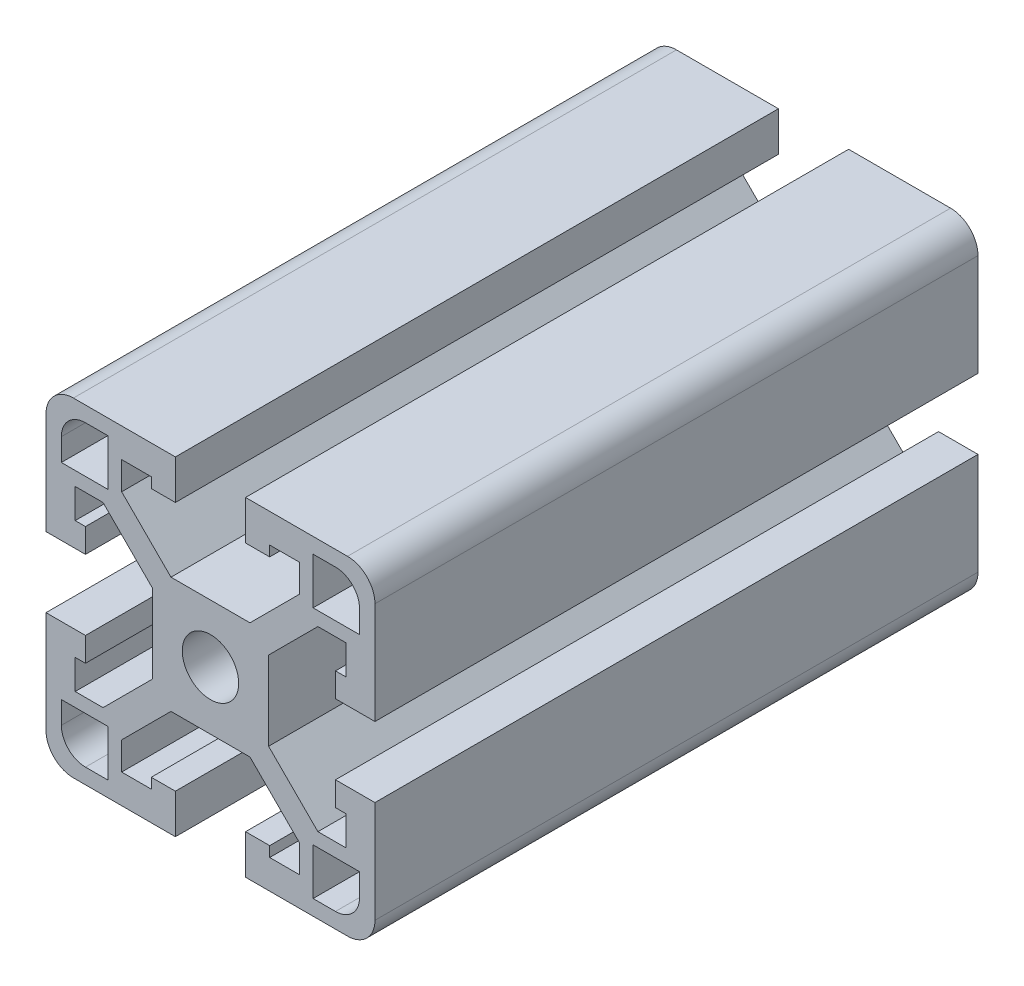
ISO-10303-21;
HEADER;
FILE_DESCRIPTION(('STEP AP214'),'2;1');
FILE_NAME('part.step','',(''),(''),'','','');
FILE_SCHEMA(('AUTOMOTIVE_DESIGN { 1 0 10303 214 1 1 1 1 }'));
ENDSEC;
DATA;
#1=APPLICATION_CONTEXT('core data for automotive mechanical design processes');
#2=APPLICATION_PROTOCOL_DEFINITION('international standard','automotive_design',2000,#1);
#3=PRODUCT_CONTEXT('',#1,'mechanical');
#4=PRODUCT('Part','Part','',(#3));
#5=PRODUCT_RELATED_PRODUCT_CATEGORY('part','',(#4));
#6=PRODUCT_DEFINITION_FORMATION('','',#4);
#7=PRODUCT_DEFINITION_CONTEXT('part definition',#1,'design');
#8=PRODUCT_DEFINITION('design','',#6,#7);
#9=PRODUCT_DEFINITION_SHAPE('','',#8);
#10=(LENGTH_UNIT() NAMED_UNIT(*) SI_UNIT(.MILLI.,.METRE.));
#11=(NAMED_UNIT(*) PLANE_ANGLE_UNIT() SI_UNIT($,.RADIAN.));
#12=(NAMED_UNIT(*) SI_UNIT($,.STERADIAN.) SOLID_ANGLE_UNIT());
#13=UNCERTAINTY_MEASURE_WITH_UNIT(LENGTH_MEASURE(1.E-05),#10,'distance_accuracy_value','');
#14=(GEOMETRIC_REPRESENTATION_CONTEXT(3) GLOBAL_UNCERTAINTY_ASSIGNED_CONTEXT((#13)) GLOBAL_UNIT_ASSIGNED_CONTEXT((#10,
#11,#12)) REPRESENTATION_CONTEXT('',''));
#15=CARTESIAN_POINT('',(0.,0.,0.));
#16=DIRECTION('',(0.,0.,1.));
#17=DIRECTION('',(1.,0.,0.));
#18=AXIS2_PLACEMENT_3D('',#15,#16,#17);
#19=CARTESIAN_POINT('',(-15.875,-15.875,34.925));
#20=DIRECTION('',(0.,0.,1.));
#21=DIRECTION('',(1.,0.,0.));
#22=AXIS2_PLACEMENT_3D('',#19,#20,#21);
#23=PLANE('',#22);
#24=DIRECTION('',(0.707106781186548,-0.707106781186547,0.));
#25=VECTOR('',#24,1.);
#26=CARTESIAN_POINT('',(-12.4422614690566,10.287,34.925));
#27=LINE('',#26,#25);
#28=CARTESIAN_POINT('',(-12.4422614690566,10.287,34.925));
#29=VERTEX_POINT('',#28);
#30=CARTESIAN_POINT('',(-6.731,4.57573853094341,34.925));
#31=VERTEX_POINT('',#30);
#32=EDGE_CURVE('E717',#29,#31,#27,.T.);
#33=ORIENTED_EDGE('',*,*,#32,.T.);
#34=DIRECTION('',(0.,-1.,0.));
#35=VECTOR('',#34,1.);
#36=CARTESIAN_POINT('',(-6.731,4.57573853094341,34.925));
#37=LINE('',#36,#35);
#38=CARTESIAN_POINT('',(-6.731,-4.5757385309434,34.925));
#39=VERTEX_POINT('',#38);
#40=EDGE_CURVE('E720',#31,#39,#37,.T.);
#41=ORIENTED_EDGE('',*,*,#40,.T.);
#42=DIRECTION('',(-0.707106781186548,-0.707106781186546,0.));
#43=VECTOR('',#42,1.);
#44=CARTESIAN_POINT('',(-6.731,-4.5757385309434,34.925));
#45=LINE('',#44,#43);
#46=CARTESIAN_POINT('',(-12.4422614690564,-10.2869999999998,34.925));
#47=VERTEX_POINT('',#46);
#48=EDGE_CURVE('E723',#39,#47,#45,.T.);
#49=ORIENTED_EDGE('',*,*,#48,.T.);
#50=DIRECTION('',(-1.,0.,0.));
#51=VECTOR('',#50,1.);
#52=CARTESIAN_POINT('',(-12.4422614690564,-10.2869999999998,34.925));
#53=LINE('',#52,#51);
#54=CARTESIAN_POINT('',(-15.6718,-10.2869999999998,34.925));
#55=VERTEX_POINT('',#54);
#56=EDGE_CURVE('E725',#47,#55,#53,.T.);
#57=ORIENTED_EDGE('',*,*,#56,.T.);
#58=DIRECTION('',(0.,1.,0.));
#59=VECTOR('',#58,1.);
#60=CARTESIAN_POINT('',(-15.6718,-10.2869999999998,34.925));
#61=LINE('',#60,#59);
#62=CARTESIAN_POINT('',(-15.6718,-6.858,34.925));
#63=VERTEX_POINT('',#62);
#64=EDGE_CURVE('E727',#55,#63,#61,.T.);
#65=ORIENTED_EDGE('',*,*,#64,.T.);
#66=DIRECTION('',(1.,0.,0.));
#67=VECTOR('',#66,1.);
#68=CARTESIAN_POINT('',(-15.6718,-6.858,34.925));
#69=LINE('',#68,#67);
#70=CARTESIAN_POINT('',(-14.478,-6.85799999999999,34.925));
#71=VERTEX_POINT('',#70);
#72=EDGE_CURVE('E729',#63,#71,#69,.T.);
#73=ORIENTED_EDGE('',*,*,#72,.T.);
#74=DIRECTION('',(0.,1.,0.));
#75=VECTOR('',#74,1.);
#76=CARTESIAN_POINT('',(-14.478,-6.85799999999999,34.925));
#77=LINE('',#76,#75);
#78=CARTESIAN_POINT('',(-14.478,-4.064,34.925));
#79=VERTEX_POINT('',#78);
#80=EDGE_CURVE('E731',#71,#79,#77,.T.);
#81=ORIENTED_EDGE('',*,*,#80,.T.);
#82=DIRECTION('',(-1.,0.,0.));
#83=VECTOR('',#82,1.);
#84=CARTESIAN_POINT('',(-14.478,-4.064,34.925));
#85=LINE('',#84,#83);
#86=CARTESIAN_POINT('',(-19.05,-4.06400000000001,34.925));
#87=VERTEX_POINT('',#86);
#88=EDGE_CURVE('E733',#79,#87,#85,.T.);
#89=ORIENTED_EDGE('',*,*,#88,.T.);
#90=DIRECTION('',(0.,-1.,0.));
#91=VECTOR('',#90,1.);
#92=CARTESIAN_POINT('',(-19.05,-4.06400000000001,34.925));
#93=LINE('',#92,#91);
#94=CARTESIAN_POINT('',(-19.05,-15.875,34.925));
#95=VERTEX_POINT('',#94);
#96=EDGE_CURVE('E735',#87,#95,#93,.T.);
#97=ORIENTED_EDGE('',*,*,#96,.T.);
#98=CARTESIAN_POINT('',(-15.875,-15.875,34.925));
#99=DIRECTION('',(0.,0.,1.));
#100=DIRECTION('',(1.,0.,0.));
#101=AXIS2_PLACEMENT_3D('',#98,#99,#100);
#102=CIRCLE('',#101,3.17499999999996);
#103=CARTESIAN_POINT('',(-15.875,-19.05,34.925));
#104=VERTEX_POINT('',#103);
#105=EDGE_CURVE('E737',#95,#104,#102,.T.);
#106=ORIENTED_EDGE('',*,*,#105,.T.);
#107=DIRECTION('',(1.,0.,0.));
#108=VECTOR('',#107,1.);
#109=CARTESIAN_POINT('',(-15.875,-19.05,34.925));
#110=LINE('',#109,#108);
#111=CARTESIAN_POINT('',(-4.064,-19.05,34.925));
#112=VERTEX_POINT('',#111);
#113=EDGE_CURVE('E739',#104,#112,#110,.T.);
#114=ORIENTED_EDGE('',*,*,#113,.T.);
#115=DIRECTION('',(0.,1.,0.));
#116=VECTOR('',#115,1.);
#117=CARTESIAN_POINT('',(-4.064,-19.05,34.925));
#118=LINE('',#117,#116);
#119=CARTESIAN_POINT('',(-4.064,-14.478,34.925));
#120=VERTEX_POINT('',#119);
#121=EDGE_CURVE('E741',#112,#120,#118,.T.);
#122=ORIENTED_EDGE('',*,*,#121,.T.);
#123=DIRECTION('',(-1.,0.,0.));
#124=VECTOR('',#123,1.);
#125=CARTESIAN_POINT('',(-4.064,-14.478,34.925));
#126=LINE('',#125,#124);
#127=CARTESIAN_POINT('',(-6.85799999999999,-14.478,34.925));
#128=VERTEX_POINT('',#127);
#129=EDGE_CURVE('E743',#120,#128,#126,.T.);
#130=ORIENTED_EDGE('',*,*,#129,.T.);
#131=DIRECTION('',(0.,-1.,0.));
#132=VECTOR('',#131,1.);
#133=CARTESIAN_POINT('',(-6.85799999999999,-14.478,34.925));
#134=LINE('',#133,#132);
#135=CARTESIAN_POINT('',(-6.85799999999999,-15.6718,34.925));
#136=VERTEX_POINT('',#135);
#137=EDGE_CURVE('E745',#128,#136,#134,.T.);
#138=ORIENTED_EDGE('',*,*,#137,.T.);
#139=DIRECTION('',(-1.,0.,0.));
#140=VECTOR('',#139,1.);
#141=CARTESIAN_POINT('',(-6.85799999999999,-15.6718,34.925));
#142=LINE('',#141,#140);
#143=CARTESIAN_POINT('',(-10.2869999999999,-15.6718,34.925));
#144=VERTEX_POINT('',#143);
#145=EDGE_CURVE('E747',#136,#144,#142,.T.);
#146=ORIENTED_EDGE('',*,*,#145,.T.);
#147=DIRECTION('',(0.,1.,0.));
#148=VECTOR('',#147,1.);
#149=CARTESIAN_POINT('',(-10.2869999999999,-15.6718,34.925));
#150=LINE('',#149,#148);
#151=CARTESIAN_POINT('',(-10.2869999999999,-12.4422614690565,34.925));
#152=VERTEX_POINT('',#151);
#153=EDGE_CURVE('E749',#144,#152,#150,.T.);
#154=ORIENTED_EDGE('',*,*,#153,.T.);
#155=DIRECTION('',(0.707106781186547,0.707106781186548,0.));
#156=VECTOR('',#155,1.);
#157=CARTESIAN_POINT('',(-10.2869999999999,-12.4422614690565,34.925));
#158=LINE('',#157,#156);
#159=CARTESIAN_POINT('',(-4.57573853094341,-6.73100000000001,34.925));
#160=VERTEX_POINT('',#159);
#161=EDGE_CURVE('E751',#152,#160,#158,.T.);
#162=ORIENTED_EDGE('',*,*,#161,.T.);
#163=DIRECTION('',(1.,0.,0.));
#164=VECTOR('',#163,1.);
#165=CARTESIAN_POINT('',(-4.57573853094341,-6.73100000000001,34.925));
#166=LINE('',#165,#164);
#167=CARTESIAN_POINT('',(4.57573853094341,-6.73100000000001,34.925));
#168=VERTEX_POINT('',#167);
#169=EDGE_CURVE('E753',#160,#168,#166,.T.);
#170=ORIENTED_EDGE('',*,*,#169,.T.);
#171=DIRECTION('',(0.707106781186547,-0.707106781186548,0.));
#172=VECTOR('',#171,1.);
#173=CARTESIAN_POINT('',(4.57573853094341,-6.73100000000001,34.925));
#174=LINE('',#173,#172);
#175=CARTESIAN_POINT('',(10.2869999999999,-12.4422614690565,34.925));
#176=VERTEX_POINT('',#175);
#177=EDGE_CURVE('E755',#168,#176,#174,.T.);
#178=ORIENTED_EDGE('',*,*,#177,.T.);
#179=DIRECTION('',(0.,-1.,0.));
#180=VECTOR('',#179,1.);
#181=CARTESIAN_POINT('',(10.2869999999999,-12.4422614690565,34.925));
#182=LINE('',#181,#180);
#183=CARTESIAN_POINT('',(10.2869999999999,-15.6718,34.925));
#184=VERTEX_POINT('',#183);
#185=EDGE_CURVE('E757',#176,#184,#182,.T.);
#186=ORIENTED_EDGE('',*,*,#185,.T.);
#187=DIRECTION('',(-1.,0.,0.));
#188=VECTOR('',#187,1.);
#189=CARTESIAN_POINT('',(10.2869999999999,-15.6718,34.925));
#190=LINE('',#189,#188);
#191=CARTESIAN_POINT('',(6.85800000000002,-15.6718,34.925));
#192=VERTEX_POINT('',#191);
#193=EDGE_CURVE('E759',#184,#192,#190,.T.);
#194=ORIENTED_EDGE('',*,*,#193,.T.);
#195=DIRECTION('',(0.,1.,0.));
#196=VECTOR('',#195,1.);
#197=CARTESIAN_POINT('',(6.85800000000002,-15.6718,34.925));
#198=LINE('',#197,#196);
#199=CARTESIAN_POINT('',(6.85800000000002,-14.478,34.925));
#200=VERTEX_POINT('',#199);
#201=EDGE_CURVE('E761',#192,#200,#198,.T.);
#202=ORIENTED_EDGE('',*,*,#201,.T.);
#203=DIRECTION('',(-1.,0.,0.));
#204=VECTOR('',#203,1.);
#205=CARTESIAN_POINT('',(6.85800000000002,-14.478,34.925));
#206=LINE('',#205,#204);
#207=CARTESIAN_POINT('',(4.06400000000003,-14.478,34.925));
#208=VERTEX_POINT('',#207);
#209=EDGE_CURVE('E763',#200,#208,#206,.T.);
#210=ORIENTED_EDGE('',*,*,#209,.T.);
#211=DIRECTION('',(0.,-1.,0.));
#212=VECTOR('',#211,1.);
#213=CARTESIAN_POINT('',(4.06400000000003,-14.478,34.925));
#214=LINE('',#213,#212);
#215=CARTESIAN_POINT('',(4.06400000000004,-19.05,34.925));
#216=VERTEX_POINT('',#215);
#217=EDGE_CURVE('E765',#208,#216,#214,.T.);
#218=ORIENTED_EDGE('',*,*,#217,.T.);
#219=DIRECTION('',(1.,0.,0.));
#220=VECTOR('',#219,1.);
#221=CARTESIAN_POINT('',(4.06400000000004,-19.05,34.925));
#222=LINE('',#221,#220);
#223=CARTESIAN_POINT('',(15.8750000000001,-19.05,34.925));
#224=VERTEX_POINT('',#223);
#225=EDGE_CURVE('E767',#216,#224,#222,.T.);
#226=ORIENTED_EDGE('',*,*,#225,.T.);
#227=CARTESIAN_POINT('',(15.8750000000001,-15.875,34.925));
#228=DIRECTION('',(0.,0.,1.));
#229=DIRECTION('',(1.,0.,0.));
#230=AXIS2_PLACEMENT_3D('',#227,#228,#229);
#231=CIRCLE('',#230,3.17499999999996);
#232=CARTESIAN_POINT('',(19.05,-15.875,34.925));
#233=VERTEX_POINT('',#232);
#234=EDGE_CURVE('E769',#224,#233,#231,.T.);
#235=ORIENTED_EDGE('',*,*,#234,.T.);
#236=DIRECTION('',(0.,1.,0.));
#237=VECTOR('',#236,1.);
#238=CARTESIAN_POINT('',(19.05,-15.875,34.925));
#239=LINE('',#238,#237);
#240=CARTESIAN_POINT('',(19.05,-4.064,34.925));
#241=VERTEX_POINT('',#240);
#242=EDGE_CURVE('E771',#233,#241,#239,.T.);
#243=ORIENTED_EDGE('',*,*,#242,.T.);
#244=DIRECTION('',(-1.,0.,0.));
#245=VECTOR('',#244,1.);
#246=CARTESIAN_POINT('',(19.05,-4.064,34.925));
#247=LINE('',#246,#245);
#248=CARTESIAN_POINT('',(14.478,-4.064,34.925));
#249=VERTEX_POINT('',#248);
#250=EDGE_CURVE('E773',#241,#249,#247,.T.);
#251=ORIENTED_EDGE('',*,*,#250,.T.);
#252=DIRECTION('',(0.,-1.,0.));
#253=VECTOR('',#252,1.);
#254=CARTESIAN_POINT('',(14.478,-4.064,34.925));
#255=LINE('',#254,#253);
#256=CARTESIAN_POINT('',(14.478,-6.85799999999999,34.925));
#257=VERTEX_POINT('',#256);
#258=EDGE_CURVE('E775',#249,#257,#255,.T.);
#259=ORIENTED_EDGE('',*,*,#258,.T.);
#260=DIRECTION('',(1.,0.,0.));
#261=VECTOR('',#260,1.);
#262=CARTESIAN_POINT('',(14.478,-6.85799999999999,34.925));
#263=LINE('',#262,#261);
#264=CARTESIAN_POINT('',(15.6718,-6.85799999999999,34.925));
#265=VERTEX_POINT('',#264);
#266=EDGE_CURVE('E777',#257,#265,#263,.T.);
#267=ORIENTED_EDGE('',*,*,#266,.T.);
#268=DIRECTION('',(0.,-1.,0.));
#269=VECTOR('',#268,1.);
#270=CARTESIAN_POINT('',(15.6718,-6.85799999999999,34.925));
#271=LINE('',#270,#269);
#272=CARTESIAN_POINT('',(15.6718,-10.2869999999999,34.925));
#273=VERTEX_POINT('',#272);
#274=EDGE_CURVE('E779',#265,#273,#271,.T.);
#275=ORIENTED_EDGE('',*,*,#274,.T.);
#276=DIRECTION('',(-1.,0.,0.));
#277=VECTOR('',#276,1.);
#278=CARTESIAN_POINT('',(15.6718,-10.2869999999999,34.925));
#279=LINE('',#278,#277);
#280=CARTESIAN_POINT('',(12.4422614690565,-10.2869999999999,34.925));
#281=VERTEX_POINT('',#280);
#282=EDGE_CURVE('E781',#273,#281,#279,.T.);
#283=ORIENTED_EDGE('',*,*,#282,.T.);
#284=DIRECTION('',(-0.707106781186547,0.707106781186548,0.));
#285=VECTOR('',#284,1.);
#286=CARTESIAN_POINT('',(12.4422614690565,-10.2869999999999,34.925));
#287=LINE('',#286,#285);
#288=CARTESIAN_POINT('',(6.73100000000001,-4.57573853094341,34.925));
#289=VERTEX_POINT('',#288);
#290=EDGE_CURVE('E783',#281,#289,#287,.T.);
#291=ORIENTED_EDGE('',*,*,#290,.T.);
#292=DIRECTION('',(0.,1.,0.));
#293=VECTOR('',#292,1.);
#294=CARTESIAN_POINT('',(6.73100000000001,-4.57573853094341,34.925));
#295=LINE('',#294,#293);
#296=CARTESIAN_POINT('',(6.73100000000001,4.5757385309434,34.925));
#297=VERTEX_POINT('',#296);
#298=EDGE_CURVE('E785',#289,#297,#295,.T.);
#299=ORIENTED_EDGE('',*,*,#298,.T.);
#300=DIRECTION('',(0.707106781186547,0.707106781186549,0.));
#301=VECTOR('',#300,1.);
#302=CARTESIAN_POINT('',(6.73100000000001,4.5757385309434,34.925));
#303=LINE('',#302,#301);
#304=CARTESIAN_POINT('',(12.4422614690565,10.2869999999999,34.925));
#305=VERTEX_POINT('',#304);
#306=EDGE_CURVE('E787',#297,#305,#303,.T.);
#307=ORIENTED_EDGE('',*,*,#306,.T.);
#308=DIRECTION('',(1.,0.,0.));
#309=VECTOR('',#308,1.);
#310=CARTESIAN_POINT('',(12.4422614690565,10.2869999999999,34.925));
#311=LINE('',#310,#309);
#312=CARTESIAN_POINT('',(15.6718,10.2870000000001,34.925));
#313=VERTEX_POINT('',#312);
#314=EDGE_CURVE('E789',#305,#313,#311,.T.);
#315=ORIENTED_EDGE('',*,*,#314,.T.);
#316=DIRECTION('',(0.,-1.,0.));
#317=VECTOR('',#316,1.);
#318=CARTESIAN_POINT('',(15.6718,10.2870000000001,34.925));
#319=LINE('',#318,#317);
#320=CARTESIAN_POINT('',(15.6718,6.858,34.925));
#321=VERTEX_POINT('',#320);
#322=EDGE_CURVE('E791',#313,#321,#319,.T.);
#323=ORIENTED_EDGE('',*,*,#322,.T.);
#324=DIRECTION('',(-1.,-1.48217284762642E-13,0.));
#325=VECTOR('',#324,1.);
#326=CARTESIAN_POINT('',(15.6718,6.858,34.925));
#327=LINE('',#326,#325);
#328=CARTESIAN_POINT('',(14.4780000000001,6.85799999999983,34.925));
#329=VERTEX_POINT('',#328);
#330=EDGE_CURVE('E793',#321,#329,#327,.T.);
#331=ORIENTED_EDGE('',*,*,#330,.T.);
#332=DIRECTION('',(0.,-1.,0.));
#333=VECTOR('',#332,1.);
#334=CARTESIAN_POINT('',(14.4780000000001,6.85799999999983,34.925));
#335=LINE('',#334,#333);
#336=CARTESIAN_POINT('',(14.4780000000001,4.06399999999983,34.925));
#337=VERTEX_POINT('',#336);
#338=EDGE_CURVE('E795',#329,#337,#335,.T.);
#339=ORIENTED_EDGE('',*,*,#338,.T.);
#340=DIRECTION('',(1.,0.,0.));
#341=VECTOR('',#340,1.);
#342=CARTESIAN_POINT('',(14.4780000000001,4.06399999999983,34.925));
#343=LINE('',#342,#341);
#344=CARTESIAN_POINT('',(19.05,4.06399999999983,34.925));
#345=VERTEX_POINT('',#344);
#346=EDGE_CURVE('E797',#337,#345,#343,.T.);
#347=ORIENTED_EDGE('',*,*,#346,.T.);
#348=DIRECTION('',(0.,1.,0.));
#349=VECTOR('',#348,1.);
#350=CARTESIAN_POINT('',(19.05,4.06399999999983,34.925));
#351=LINE('',#350,#349);
#352=CARTESIAN_POINT('',(19.05,15.8750000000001,34.925));
#353=VERTEX_POINT('',#352);
#354=EDGE_CURVE('E799',#345,#353,#351,.T.);
#355=ORIENTED_EDGE('',*,*,#354,.T.);
#356=CARTESIAN_POINT('',(15.8750000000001,15.8750000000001,34.925));
#357=DIRECTION('',(0.,0.,1.));
#358=DIRECTION('',(1.,0.,0.));
#359=AXIS2_PLACEMENT_3D('',#356,#357,#358);
#360=CIRCLE('',#359,3.17499999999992);
#361=CARTESIAN_POINT('',(15.875,19.05,34.925));
#362=VERTEX_POINT('',#361);
#363=EDGE_CURVE('E801',#353,#362,#360,.T.);
#364=ORIENTED_EDGE('',*,*,#363,.T.);
#365=DIRECTION('',(-1.,0.,0.));
#366=VECTOR('',#365,1.);
#367=CARTESIAN_POINT('',(15.875,19.05,34.925));
#368=LINE('',#367,#366);
#369=CARTESIAN_POINT('',(4.06399999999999,19.05,34.925));
#370=VERTEX_POINT('',#369);
#371=EDGE_CURVE('E803',#362,#370,#368,.T.);
#372=ORIENTED_EDGE('',*,*,#371,.T.);
#373=DIRECTION('',(0.,-1.,0.));
#374=VECTOR('',#373,1.);
#375=CARTESIAN_POINT('',(4.06399999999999,19.05,34.925));
#376=LINE('',#375,#374);
#377=CARTESIAN_POINT('',(4.06399999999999,14.478,34.925));
#378=VERTEX_POINT('',#377);
#379=EDGE_CURVE('E805',#370,#378,#376,.T.);
#380=ORIENTED_EDGE('',*,*,#379,.T.);
#381=DIRECTION('',(1.,0.,0.));
#382=VECTOR('',#381,1.);
#383=CARTESIAN_POINT('',(4.06399999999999,14.478,34.925));
#384=LINE('',#383,#382);
#385=CARTESIAN_POINT('',(6.85799999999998,14.478,34.925));
#386=VERTEX_POINT('',#385);
#387=EDGE_CURVE('E807',#378,#386,#384,.T.);
#388=ORIENTED_EDGE('',*,*,#387,.T.);
#389=DIRECTION('',(0.,1.,0.));
#390=VECTOR('',#389,1.);
#391=CARTESIAN_POINT('',(6.85799999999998,14.478,34.925));
#392=LINE('',#391,#390);
#393=CARTESIAN_POINT('',(6.85799999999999,15.6718000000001,34.925));
#394=VERTEX_POINT('',#393);
#395=EDGE_CURVE('E809',#386,#394,#392,.T.);
#396=ORIENTED_EDGE('',*,*,#395,.T.);
#397=DIRECTION('',(1.,0.,0.));
#398=VECTOR('',#397,1.);
#399=CARTESIAN_POINT('',(6.85799999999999,15.6718000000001,34.925));
#400=LINE('',#399,#398);
#401=CARTESIAN_POINT('',(10.2869999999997,15.6718000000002,34.925));
#402=VERTEX_POINT('',#401);
#403=EDGE_CURVE('E811',#394,#402,#400,.T.);
#404=ORIENTED_EDGE('',*,*,#403,.T.);
#405=DIRECTION('',(0.,-1.,0.));
#406=VECTOR('',#405,1.);
#407=CARTESIAN_POINT('',(10.2869999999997,15.6718000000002,34.925));
#408=LINE('',#407,#406);
#409=CARTESIAN_POINT('',(10.2869999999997,12.4422614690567,34.925));
#410=VERTEX_POINT('',#409);
#411=EDGE_CURVE('E813',#402,#410,#408,.T.);
#412=ORIENTED_EDGE('',*,*,#411,.T.);
#413=DIRECTION('',(-0.707106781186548,-0.707106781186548,0.));
#414=VECTOR('',#413,1.);
#415=CARTESIAN_POINT('',(10.2869999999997,12.4422614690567,34.925));
#416=LINE('',#415,#414);
#417=CARTESIAN_POINT('',(4.57573853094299,6.73100000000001,34.925));
#418=VERTEX_POINT('',#417);
#419=EDGE_CURVE('E815',#410,#418,#416,.T.);
#420=ORIENTED_EDGE('',*,*,#419,.T.);
#421=DIRECTION('',(-1.,0.,0.));
#422=VECTOR('',#421,1.);
#423=CARTESIAN_POINT('',(4.57573853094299,6.73100000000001,34.925));
#424=LINE('',#423,#422);
#425=CARTESIAN_POINT('',(-4.57573853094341,6.73100000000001,34.925));
#426=VERTEX_POINT('',#425);
#427=EDGE_CURVE('E817',#418,#426,#424,.T.);
#428=ORIENTED_EDGE('',*,*,#427,.T.);
#429=DIRECTION('',(-0.707106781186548,0.707106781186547,0.));
#430=VECTOR('',#429,1.);
#431=CARTESIAN_POINT('',(-4.57573853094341,6.73100000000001,34.925));
#432=LINE('',#431,#430);
#433=CARTESIAN_POINT('',(-10.287,12.4422614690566,34.925));
#434=VERTEX_POINT('',#433);
#435=EDGE_CURVE('E819',#426,#434,#432,.T.);
#436=ORIENTED_EDGE('',*,*,#435,.T.);
#437=DIRECTION('',(0.,1.,0.));
#438=VECTOR('',#437,1.);
#439=CARTESIAN_POINT('',(-10.287,12.4422614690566,34.925));
#440=LINE('',#439,#438);
#441=CARTESIAN_POINT('',(-10.287,15.6718,34.925));
#442=VERTEX_POINT('',#441);
#443=EDGE_CURVE('E821',#434,#442,#440,.T.);
#444=ORIENTED_EDGE('',*,*,#443,.T.);
#445=DIRECTION('',(1.,0.,0.));
#446=VECTOR('',#445,1.);
#447=CARTESIAN_POINT('',(-10.287,15.6718,34.925));
#448=LINE('',#447,#446);
#449=CARTESIAN_POINT('',(-6.858,15.6718,34.925));
#450=VERTEX_POINT('',#449);
#451=EDGE_CURVE('E823',#442,#450,#448,.T.);
#452=ORIENTED_EDGE('',*,*,#451,.T.);
#453=DIRECTION('',(0.,-1.,0.));
#454=VECTOR('',#453,1.);
#455=CARTESIAN_POINT('',(-6.858,15.6718,34.925));
#456=LINE('',#455,#454);
#457=CARTESIAN_POINT('',(-6.858,14.478,34.925));
#458=VERTEX_POINT('',#457);
#459=EDGE_CURVE('E825',#450,#458,#456,.T.);
#460=ORIENTED_EDGE('',*,*,#459,.T.);
#461=DIRECTION('',(1.,0.,0.));
#462=VECTOR('',#461,1.);
#463=CARTESIAN_POINT('',(-6.858,14.478,34.925));
#464=LINE('',#463,#462);
#465=CARTESIAN_POINT('',(-4.064,14.478,34.925));
#466=VERTEX_POINT('',#465);
#467=EDGE_CURVE('E827',#458,#466,#464,.T.);
#468=ORIENTED_EDGE('',*,*,#467,.T.);
#469=DIRECTION('',(0.,1.,0.));
#470=VECTOR('',#469,1.);
#471=CARTESIAN_POINT('',(-4.064,14.478,34.925));
#472=LINE('',#471,#470);
#473=CARTESIAN_POINT('',(-4.06400000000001,19.05,34.925));
#474=VERTEX_POINT('',#473);
#475=EDGE_CURVE('E829',#466,#474,#472,.T.);
#476=ORIENTED_EDGE('',*,*,#475,.T.);
#477=DIRECTION('',(-1.,0.,0.));
#478=VECTOR('',#477,1.);
#479=CARTESIAN_POINT('',(-4.06400000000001,19.05,34.925));
#480=LINE('',#479,#478);
#481=CARTESIAN_POINT('',(-15.875,19.05,34.925));
#482=VERTEX_POINT('',#481);
#483=EDGE_CURVE('E831',#474,#482,#480,.T.);
#484=ORIENTED_EDGE('',*,*,#483,.T.);
#485=CARTESIAN_POINT('',(-15.875,15.875,34.925));
#486=DIRECTION('',(0.,0.,1.));
#487=DIRECTION('',(1.,0.,0.));
#488=AXIS2_PLACEMENT_3D('',#485,#486,#487);
#489=CIRCLE('',#488,3.17499999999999);
#490=CARTESIAN_POINT('',(-19.05,15.875,34.925));
#491=VERTEX_POINT('',#490);
#492=EDGE_CURVE('E833',#482,#491,#489,.T.);
#493=ORIENTED_EDGE('',*,*,#492,.T.);
#494=DIRECTION('',(0.,-1.,0.));
#495=VECTOR('',#494,1.);
#496=CARTESIAN_POINT('',(-19.05,15.875,34.925));
#497=LINE('',#496,#495);
#498=CARTESIAN_POINT('',(-19.05,4.06400000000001,34.925));
#499=VERTEX_POINT('',#498);
#500=EDGE_CURVE('E835',#491,#499,#497,.T.);
#501=ORIENTED_EDGE('',*,*,#500,.T.);
#502=DIRECTION('',(1.,0.,0.));
#503=VECTOR('',#502,1.);
#504=CARTESIAN_POINT('',(-19.05,4.06400000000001,34.925));
#505=LINE('',#504,#503);
#506=CARTESIAN_POINT('',(-14.478,4.06400000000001,34.925));
#507=VERTEX_POINT('',#506);
#508=EDGE_CURVE('E837',#499,#507,#505,.T.);
#509=ORIENTED_EDGE('',*,*,#508,.T.);
#510=DIRECTION('',(0.,1.,0.));
#511=VECTOR('',#510,1.);
#512=CARTESIAN_POINT('',(-14.478,4.06400000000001,34.925));
#513=LINE('',#512,#511);
#514=CARTESIAN_POINT('',(-14.478,6.85800000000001,34.925));
#515=VERTEX_POINT('',#514);
#516=EDGE_CURVE('E839',#507,#515,#513,.T.);
#517=ORIENTED_EDGE('',*,*,#516,.T.);
#518=DIRECTION('',(-1.,0.,0.));
#519=VECTOR('',#518,1.);
#520=CARTESIAN_POINT('',(-14.478,6.85800000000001,34.925));
#521=LINE('',#520,#519);
#522=CARTESIAN_POINT('',(-15.6718,6.85800000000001,34.925));
#523=VERTEX_POINT('',#522);
#524=EDGE_CURVE('E841',#515,#523,#521,.T.);
#525=ORIENTED_EDGE('',*,*,#524,.T.);
#526=DIRECTION('',(0.,1.,0.));
#527=VECTOR('',#526,1.);
#528=CARTESIAN_POINT('',(-15.6718,6.85800000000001,34.925));
#529=LINE('',#528,#527);
#530=CARTESIAN_POINT('',(-15.6718,10.2870000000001,34.925));
#531=VERTEX_POINT('',#530);
#532=EDGE_CURVE('E843',#523,#531,#529,.T.);
#533=ORIENTED_EDGE('',*,*,#532,.T.);
#534=DIRECTION('',(1.,0.,0.));
#535=VECTOR('',#534,1.);
#536=CARTESIAN_POINT('',(-15.6718,10.2870000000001,34.925));
#537=LINE('',#536,#535);
#538=EDGE_CURVE('E845',#531,#29,#537,.T.);
#539=ORIENTED_EDGE('',*,*,#538,.T.);
#540=EDGE_LOOP('',(#33,#41,#49,#57,#65,#73,#81,#89,#97,#106,#114,#122,#130,#138,#146,#154,#162,
#170,#178,#186,#194,#202,#210,#218,#226,#235,#243,#251,#259,#267,#275,#283,#291,#299,#307,#315,
#323,#331,#339,#347,#355,#364,#372,#380,#388,#396,#404,#412,#420,#428,#436,#444,#452,#460,#468,
#476,#484,#493,#501,#509,#517,#525,#533,#539));
#541=FACE_BOUND('',#540,.T.);
#542=CARTESIAN_POINT('',(0.,0.,34.925));
#543=DIRECTION('',(0.,0.,1.));
#544=DIRECTION('',(1.,0.,0.));
#545=AXIS2_PLACEMENT_3D('',#542,#543,#544);
#546=CIRCLE('',#545,3.26390000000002);
#547=CARTESIAN_POINT('',(3.26390000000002,0.,34.925));
#548=VERTEX_POINT('',#547);
#549=EDGE_CURVE('E711',#548,#548,#546,.T.);
#550=ORIENTED_EDGE('',*,*,#549,.F.);
#551=EDGE_LOOP('',(#550));
#552=FACE_BOUND('',#551,.T.);
#553=DIRECTION('',(0.,-1.,0.));
#554=VECTOR('',#553,1.);
#555=CARTESIAN_POINT('',(-17.272,14.478,34.925));
#556=LINE('',#555,#554);
#557=CARTESIAN_POINT('',(-17.272,14.478,34.925));
#558=VERTEX_POINT('',#557);
#559=CARTESIAN_POINT('',(-17.272,11.8872,34.925));
#560=VERTEX_POINT('',#559);
#561=EDGE_CURVE('E675',#558,#560,#556,.T.);
#562=ORIENTED_EDGE('',*,*,#561,.F.);
#563=CARTESIAN_POINT('',(-14.478,14.478,34.925));
#564=DIRECTION('',(0.,0.,1.));
#565=DIRECTION('',(1.,0.,0.));
#566=AXIS2_PLACEMENT_3D('',#563,#564,#565);
#567=CIRCLE('',#566,2.794);
#568=CARTESIAN_POINT('',(-14.478,17.272,34.925));
#569=VERTEX_POINT('',#568);
#570=EDGE_CURVE('E673',#569,#558,#567,.T.);
#571=ORIENTED_EDGE('',*,*,#570,.F.);
#572=DIRECTION('',(-1.,0.,0.));
#573=VECTOR('',#572,1.);
#574=CARTESIAN_POINT('',(-11.8872,17.272,34.925));
#575=LINE('',#574,#573);
#576=CARTESIAN_POINT('',(-11.8872,17.272,34.925));
#577=VERTEX_POINT('',#576);
#578=EDGE_CURVE('E683',#577,#569,#575,.T.);
#579=ORIENTED_EDGE('',*,*,#578,.F.);
#580=DIRECTION('',(0.,1.,0.));
#581=VECTOR('',#580,1.);
#582=CARTESIAN_POINT('',(-11.8872,11.8872,34.925));
#583=LINE('',#582,#581);
#584=CARTESIAN_POINT('',(-11.8872,11.8872,34.925));
#585=VERTEX_POINT('',#584);
#586=EDGE_CURVE('E680',#585,#577,#583,.T.);
#587=ORIENTED_EDGE('',*,*,#586,.F.);
#588=DIRECTION('',(1.,0.,0.));
#589=VECTOR('',#588,1.);
#590=CARTESIAN_POINT('',(-17.272,11.8872,34.925));
#591=LINE('',#590,#589);
#592=EDGE_CURVE('E678',#560,#585,#591,.T.);
#593=ORIENTED_EDGE('',*,*,#592,.F.);
#594=EDGE_LOOP('',(#562,#571,#579,#587,#593));
#595=FACE_BOUND('',#594,.T.);
#596=DIRECTION('',(1.,0.,0.));
#597=VECTOR('',#596,1.);
#598=CARTESIAN_POINT('',(11.8872,11.8872,34.925));
#599=LINE('',#598,#597);
#600=CARTESIAN_POINT('',(11.8872,11.8872,34.925));
#601=VERTEX_POINT('',#600);
#602=CARTESIAN_POINT('',(17.272,11.8872,34.925));
#603=VERTEX_POINT('',#602);
#604=EDGE_CURVE('E637',#601,#603,#599,.T.);
#605=ORIENTED_EDGE('',*,*,#604,.F.);
#606=DIRECTION('',(0.,-1.,0.));
#607=VECTOR('',#606,1.);
#608=CARTESIAN_POINT('',(11.8872,17.272,34.925));
#609=LINE('',#608,#607);
#610=CARTESIAN_POINT('',(11.8872,17.272,34.925));
#611=VERTEX_POINT('',#610);
#612=EDGE_CURVE('E635',#611,#601,#609,.T.);
#613=ORIENTED_EDGE('',*,*,#612,.F.);
#614=DIRECTION('',(-1.,0.,0.));
#615=VECTOR('',#614,1.);
#616=CARTESIAN_POINT('',(14.478,17.272,34.925));
#617=LINE('',#616,#615);
#618=CARTESIAN_POINT('',(14.478,17.272,34.925));
#619=VERTEX_POINT('',#618);
#620=EDGE_CURVE('E645',#619,#611,#617,.T.);
#621=ORIENTED_EDGE('',*,*,#620,.F.);
#622=CARTESIAN_POINT('',(14.478,14.478,34.925));
#623=DIRECTION('',(0.,0.,1.));
#624=DIRECTION('',(1.,0.,0.));
#625=AXIS2_PLACEMENT_3D('',#622,#623,#624);
#626=CIRCLE('',#625,2.794);
#627=CARTESIAN_POINT('',(17.272,14.478,34.925));
#628=VERTEX_POINT('',#627);
#629=EDGE_CURVE('E642',#628,#619,#626,.T.);
#630=ORIENTED_EDGE('',*,*,#629,.F.);
#631=DIRECTION('',(0.,1.,0.));
#632=VECTOR('',#631,1.);
#633=CARTESIAN_POINT('',(17.272,11.8872,34.925));
#634=LINE('',#633,#632);
#635=EDGE_CURVE('E640',#603,#628,#634,.T.);
#636=ORIENTED_EDGE('',*,*,#635,.F.);
#637=EDGE_LOOP('',(#605,#613,#621,#630,#636));
#638=FACE_BOUND('',#637,.T.);
#639=DIRECTION('',(0.,1.,0.));
#640=VECTOR('',#639,1.);
#641=CARTESIAN_POINT('',(17.272,-14.478,34.925));
#642=LINE('',#641,#640);
#643=CARTESIAN_POINT('',(17.272,-14.478,34.925));
#644=VERTEX_POINT('',#643);
#645=CARTESIAN_POINT('',(17.272,-11.8872,34.925));
#646=VERTEX_POINT('',#645);
#647=EDGE_CURVE('E599',#644,#646,#642,.T.);
#648=ORIENTED_EDGE('',*,*,#647,.F.);
#649=CARTESIAN_POINT('',(14.478,-14.478,34.925));
#650=DIRECTION('',(0.,0.,1.));
#651=DIRECTION('',(1.,0.,0.));
#652=AXIS2_PLACEMENT_3D('',#649,#650,#651);
#653=CIRCLE('',#652,2.794);
#654=CARTESIAN_POINT('',(14.478,-17.272,34.925));
#655=VERTEX_POINT('',#654);
#656=EDGE_CURVE('E597',#655,#644,#653,.T.);
#657=ORIENTED_EDGE('',*,*,#656,.F.);
#658=DIRECTION('',(1.,0.,0.));
#659=VECTOR('',#658,1.);
#660=CARTESIAN_POINT('',(11.8872,-17.272,34.925));
#661=LINE('',#660,#659);
#662=CARTESIAN_POINT('',(11.8872,-17.272,34.925));
#663=VERTEX_POINT('',#662);
#664=EDGE_CURVE('E607',#663,#655,#661,.T.);
#665=ORIENTED_EDGE('',*,*,#664,.F.);
#666=DIRECTION('',(0.,-1.,0.));
#667=VECTOR('',#666,1.);
#668=CARTESIAN_POINT('',(11.8872,-11.8872,34.925));
#669=LINE('',#668,#667);
#670=CARTESIAN_POINT('',(11.8872,-11.8872,34.925));
#671=VERTEX_POINT('',#670);
#672=EDGE_CURVE('E604',#671,#663,#669,.T.);
#673=ORIENTED_EDGE('',*,*,#672,.F.);
#674=DIRECTION('',(-1.,0.,0.));
#675=VECTOR('',#674,1.);
#676=CARTESIAN_POINT('',(17.272,-11.8872,34.925));
#677=LINE('',#676,#675);
#678=EDGE_CURVE('E602',#646,#671,#677,.T.);
#679=ORIENTED_EDGE('',*,*,#678,.F.);
#680=EDGE_LOOP('',(#648,#657,#665,#673,#679));
#681=FACE_BOUND('',#680,.T.);
#682=DIRECTION('',(-1.,0.,0.));
#683=VECTOR('',#682,1.);
#684=CARTESIAN_POINT('',(-11.8872,-11.8872,34.925));
#685=LINE('',#684,#683);
#686=CARTESIAN_POINT('',(-11.8872,-11.8872,34.925));
#687=VERTEX_POINT('',#686);
#688=CARTESIAN_POINT('',(-17.272,-11.8872,34.925));
#689=VERTEX_POINT('',#688);
#690=EDGE_CURVE('E561',#687,#689,#685,.T.);
#691=ORIENTED_EDGE('',*,*,#690,.F.);
#692=DIRECTION('',(0.,1.,0.));
#693=VECTOR('',#692,1.);
#694=CARTESIAN_POINT('',(-11.8872,-17.272,34.925));
#695=LINE('',#694,#693);
#696=CARTESIAN_POINT('',(-11.8872,-17.272,34.925));
#697=VERTEX_POINT('',#696);
#698=EDGE_CURVE('E553',#697,#687,#695,.T.);
#699=ORIENTED_EDGE('',*,*,#698,.F.);
#700=DIRECTION('',(1.,0.,0.));
#701=VECTOR('',#700,1.);
#702=CARTESIAN_POINT('',(-14.478,-17.272,34.925));
#703=LINE('',#702,#701);
#704=CARTESIAN_POINT('',(-14.478,-17.272,34.925));
#705=VERTEX_POINT('',#704);
#706=EDGE_CURVE('E580',#705,#697,#703,.T.);
#707=ORIENTED_EDGE('',*,*,#706,.F.);
#708=CARTESIAN_POINT('',(-14.478,-14.478,34.925));
#709=DIRECTION('',(0.,0.,1.));
#710=DIRECTION('',(1.,0.,0.));
#711=AXIS2_PLACEMENT_3D('',#708,#709,#710);
#712=CIRCLE('',#711,2.794);
#713=CARTESIAN_POINT('',(-17.272,-14.478,34.925));
#714=VERTEX_POINT('',#713);
#715=EDGE_CURVE('E576',#714,#705,#712,.T.);
#716=ORIENTED_EDGE('',*,*,#715,.F.);
#717=DIRECTION('',(0.,-1.,0.));
#718=VECTOR('',#717,1.);
#719=CARTESIAN_POINT('',(-17.272,-11.8872,34.925));
#720=LINE('',#719,#718);
#721=EDGE_CURVE('E574',#689,#714,#720,.T.);
#722=ORIENTED_EDGE('',*,*,#721,.F.);
#723=EDGE_LOOP('',(#691,#699,#707,#716,#722));
#724=FACE_BOUND('',#723,.T.);
#725=ADVANCED_FACE('F32',(#541,#552,#595,#638,#681,#724),#23,.T.);
#726=CARTESIAN_POINT('',(-15.875,-15.875,-34.925));
#727=DIRECTION('',(0.,0.,1.));
#728=DIRECTION('',(1.,0.,0.));
#729=AXIS2_PLACEMENT_3D('',#726,#727,#728);
#730=PLANE('',#729);
#731=CARTESIAN_POINT('',(14.478,-14.478,-34.925));
#732=DIRECTION('',(0.,0.,1.));
#733=DIRECTION('',(1.,0.,0.));
#734=AXIS2_PLACEMENT_3D('',#731,#732,#733);
#735=CIRCLE('',#734,2.794);
#736=CARTESIAN_POINT('',(14.478,-17.272,-34.925));
#737=VERTEX_POINT('',#736);
#738=CARTESIAN_POINT('',(17.272,-14.478,-34.925));
#739=VERTEX_POINT('',#738);
#740=EDGE_CURVE('E569',#737,#739,#735,.T.);
#741=ORIENTED_EDGE('',*,*,#740,.T.);
#742=DIRECTION('',(0.,1.,0.));
#743=VECTOR('',#742,1.);
#744=CARTESIAN_POINT('',(17.272,-14.478,-34.925));
#745=LINE('',#744,#743);
#746=CARTESIAN_POINT('',(17.272,-11.8872,-34.925));
#747=VERTEX_POINT('',#746);
#748=EDGE_CURVE('E612',#739,#747,#745,.T.);
#749=ORIENTED_EDGE('',*,*,#748,.T.);
#750=DIRECTION('',(-1.,0.,0.));
#751=VECTOR('',#750,1.);
#752=CARTESIAN_POINT('',(17.272,-11.8872,-34.925));
#753=LINE('',#752,#751);
#754=CARTESIAN_POINT('',(11.8872,-11.8872,-34.925));
#755=VERTEX_POINT('',#754);
#756=EDGE_CURVE('E615',#747,#755,#753,.T.);
#757=ORIENTED_EDGE('',*,*,#756,.T.);
#758=DIRECTION('',(0.,-1.,0.));
#759=VECTOR('',#758,1.);
#760=CARTESIAN_POINT('',(11.8872,-11.8872,-34.925));
#761=LINE('',#760,#759);
#762=CARTESIAN_POINT('',(11.8872,-17.272,-34.925));
#763=VERTEX_POINT('',#762);
#764=EDGE_CURVE('E618',#755,#763,#761,.T.);
#765=ORIENTED_EDGE('',*,*,#764,.T.);
#766=DIRECTION('',(1.,0.,0.));
#767=VECTOR('',#766,1.);
#768=CARTESIAN_POINT('',(11.8872,-17.272,-34.925));
#769=LINE('',#768,#767);
#770=EDGE_CURVE('E600',#763,#737,#769,.T.);
#771=ORIENTED_EDGE('',*,*,#770,.T.);
#772=EDGE_LOOP('',(#741,#749,#757,#765,#771));
#773=FACE_BOUND('',#772,.T.);
#774=CARTESIAN_POINT('',(-14.478,14.478,-34.925));
#775=DIRECTION('',(0.,0.,1.));
#776=DIRECTION('',(1.,0.,0.));
#777=AXIS2_PLACEMENT_3D('',#774,#775,#776);
#778=CIRCLE('',#777,2.794);
#779=CARTESIAN_POINT('',(-14.478,17.272,-34.925));
#780=VERTEX_POINT('',#779);
#781=CARTESIAN_POINT('',(-17.272,14.478,-34.925));
#782=VERTEX_POINT('',#781);
#783=EDGE_CURVE('E672',#780,#782,#778,.T.);
#784=ORIENTED_EDGE('',*,*,#783,.T.);
#785=DIRECTION('',(0.,-1.,0.));
#786=VECTOR('',#785,1.);
#787=CARTESIAN_POINT('',(-17.272,14.478,-34.925));
#788=LINE('',#787,#786);
#789=CARTESIAN_POINT('',(-17.272,11.8872,-34.925));
#790=VERTEX_POINT('',#789);
#791=EDGE_CURVE('E688',#782,#790,#788,.T.);
#792=ORIENTED_EDGE('',*,*,#791,.T.);
#793=DIRECTION('',(1.,0.,0.));
#794=VECTOR('',#793,1.);
#795=CARTESIAN_POINT('',(-17.272,11.8872,-34.925));
#796=LINE('',#795,#794);
#797=CARTESIAN_POINT('',(-11.8872,11.8872,-34.925));
#798=VERTEX_POINT('',#797);
#799=EDGE_CURVE('E691',#790,#798,#796,.T.);
#800=ORIENTED_EDGE('',*,*,#799,.T.);
#801=DIRECTION('',(0.,1.,0.));
#802=VECTOR('',#801,1.);
#803=CARTESIAN_POINT('',(-11.8872,11.8872,-34.925));
#804=LINE('',#803,#802);
#805=CARTESIAN_POINT('',(-11.8872,17.272,-34.925));
#806=VERTEX_POINT('',#805);
#807=EDGE_CURVE('E694',#798,#806,#804,.T.);
#808=ORIENTED_EDGE('',*,*,#807,.T.);
#809=DIRECTION('',(-1.,0.,0.));
#810=VECTOR('',#809,1.);
#811=CARTESIAN_POINT('',(-11.8872,17.272,-34.925));
#812=LINE('',#811,#810);
#813=EDGE_CURVE('E676',#806,#780,#812,.T.);
#814=ORIENTED_EDGE('',*,*,#813,.T.);
#815=EDGE_LOOP('',(#784,#792,#800,#808,#814));
#816=FACE_BOUND('',#815,.T.);
#817=DIRECTION('',(0.707106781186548,-0.707106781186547,0.));
#818=VECTOR('',#817,1.);
#819=CARTESIAN_POINT('',(-12.4422614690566,10.287,-34.925));
#820=LINE('',#819,#818);
#821=CARTESIAN_POINT('',(-12.4422614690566,10.287,-34.925));
#822=VERTEX_POINT('',#821);
#823=CARTESIAN_POINT('',(-6.731,4.57573853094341,-34.925));
#824=VERTEX_POINT('',#823);
#825=EDGE_CURVE('E714',#822,#824,#820,.T.);
#826=ORIENTED_EDGE('',*,*,#825,.F.);
#827=DIRECTION('',(1.,0.,0.));
#828=VECTOR('',#827,1.);
#829=CARTESIAN_POINT('',(-15.6718,10.2870000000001,-34.925));
#830=LINE('',#829,#828);
#831=CARTESIAN_POINT('',(-15.6718,10.2870000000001,-34.925));
#832=VERTEX_POINT('',#831);
#833=EDGE_CURVE('E721',#832,#822,#830,.T.);
#834=ORIENTED_EDGE('',*,*,#833,.F.);
#835=DIRECTION('',(0.,1.,0.));
#836=VECTOR('',#835,1.);
#837=CARTESIAN_POINT('',(-15.6718,6.85800000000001,-34.925));
#838=LINE('',#837,#836);
#839=CARTESIAN_POINT('',(-15.6718,6.85800000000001,-34.925));
#840=VERTEX_POINT('',#839);
#841=EDGE_CURVE('E972',#840,#832,#838,.T.);
#842=ORIENTED_EDGE('',*,*,#841,.F.);
#843=DIRECTION('',(-1.,0.,0.));
#844=VECTOR('',#843,1.);
#845=CARTESIAN_POINT('',(-14.478,6.85800000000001,-34.925));
#846=LINE('',#845,#844);
#847=CARTESIAN_POINT('',(-14.478,6.85800000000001,-34.925));
#848=VERTEX_POINT('',#847);
#849=EDGE_CURVE('E970',#848,#840,#846,.T.);
#850=ORIENTED_EDGE('',*,*,#849,.F.);
#851=DIRECTION('',(0.,1.,0.));
#852=VECTOR('',#851,1.);
#853=CARTESIAN_POINT('',(-14.478,4.06400000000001,-34.925));
#854=LINE('',#853,#852);
#855=CARTESIAN_POINT('',(-14.478,4.06400000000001,-34.925));
#856=VERTEX_POINT('',#855);
#857=EDGE_CURVE('E968',#856,#848,#854,.T.);
#858=ORIENTED_EDGE('',*,*,#857,.F.);
#859=DIRECTION('',(1.,0.,0.));
#860=VECTOR('',#859,1.);
#861=CARTESIAN_POINT('',(-19.05,4.06400000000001,-34.925));
#862=LINE('',#861,#860);
#863=CARTESIAN_POINT('',(-19.05,4.06400000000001,-34.925));
#864=VERTEX_POINT('',#863);
#865=EDGE_CURVE('E966',#864,#856,#862,.T.);
#866=ORIENTED_EDGE('',*,*,#865,.F.);
#867=DIRECTION('',(0.,-1.,0.));
#868=VECTOR('',#867,1.);
#869=CARTESIAN_POINT('',(-19.05,15.875,-34.925));
#870=LINE('',#869,#868);
#871=CARTESIAN_POINT('',(-19.05,15.875,-34.925));
#872=VERTEX_POINT('',#871);
#873=EDGE_CURVE('E964',#872,#864,#870,.T.);
#874=ORIENTED_EDGE('',*,*,#873,.F.);
#875=CARTESIAN_POINT('',(-15.875,15.875,-34.925));
#876=DIRECTION('',(0.,0.,1.));
#877=DIRECTION('',(1.,0.,0.));
#878=AXIS2_PLACEMENT_3D('',#875,#876,#877);
#879=CIRCLE('',#878,3.17499999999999);
#880=CARTESIAN_POINT('',(-15.875,19.05,-34.925));
#881=VERTEX_POINT('',#880);
#882=EDGE_CURVE('E962',#881,#872,#879,.T.);
#883=ORIENTED_EDGE('',*,*,#882,.F.);
#884=DIRECTION('',(-1.,0.,0.));
#885=VECTOR('',#884,1.);
#886=CARTESIAN_POINT('',(-4.06400000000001,19.05,-34.925));
#887=LINE('',#886,#885);
#888=CARTESIAN_POINT('',(-4.06400000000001,19.05,-34.925));
#889=VERTEX_POINT('',#888);
#890=EDGE_CURVE('E960',#889,#881,#887,.T.);
#891=ORIENTED_EDGE('',*,*,#890,.F.);
#892=DIRECTION('',(0.,1.,0.));
#893=VECTOR('',#892,1.);
#894=CARTESIAN_POINT('',(-4.064,14.478,-34.925));
#895=LINE('',#894,#893);
#896=CARTESIAN_POINT('',(-4.064,14.478,-34.925));
#897=VERTEX_POINT('',#896);
#898=EDGE_CURVE('E958',#897,#889,#895,.T.);
#899=ORIENTED_EDGE('',*,*,#898,.F.);
#900=DIRECTION('',(1.,0.,0.));
#901=VECTOR('',#900,1.);
#902=CARTESIAN_POINT('',(-6.858,14.478,-34.925));
#903=LINE('',#902,#901);
#904=CARTESIAN_POINT('',(-6.858,14.478,-34.925));
#905=VERTEX_POINT('',#904);
#906=EDGE_CURVE('E956',#905,#897,#903,.T.);
#907=ORIENTED_EDGE('',*,*,#906,.F.);
#908=DIRECTION('',(0.,-1.,0.));
#909=VECTOR('',#908,1.);
#910=CARTESIAN_POINT('',(-6.858,15.6718,-34.925));
#911=LINE('',#910,#909);
#912=CARTESIAN_POINT('',(-6.858,15.6718,-34.925));
#913=VERTEX_POINT('',#912);
#914=EDGE_CURVE('E954',#913,#905,#911,.T.);
#915=ORIENTED_EDGE('',*,*,#914,.F.);
#916=DIRECTION('',(1.,0.,0.));
#917=VECTOR('',#916,1.);
#918=CARTESIAN_POINT('',(-10.287,15.6718,-34.925));
#919=LINE('',#918,#917);
#920=CARTESIAN_POINT('',(-10.287,15.6718,-34.925));
#921=VERTEX_POINT('',#920);
#922=EDGE_CURVE('E952',#921,#913,#919,.T.);
#923=ORIENTED_EDGE('',*,*,#922,.F.);
#924=DIRECTION('',(0.,1.,0.));
#925=VECTOR('',#924,1.);
#926=CARTESIAN_POINT('',(-10.287,12.4422614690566,-34.925));
#927=LINE('',#926,#925);
#928=CARTESIAN_POINT('',(-10.287,12.4422614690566,-34.925));
#929=VERTEX_POINT('',#928);
#930=EDGE_CURVE('E950',#929,#921,#927,.T.);
#931=ORIENTED_EDGE('',*,*,#930,.F.);
#932=DIRECTION('',(-0.707106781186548,0.707106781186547,0.));
#933=VECTOR('',#932,1.);
#934=CARTESIAN_POINT('',(-4.57573853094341,6.73100000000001,-34.925));
#935=LINE('',#934,#933);
#936=CARTESIAN_POINT('',(-4.57573853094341,6.73100000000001,-34.925));
#937=VERTEX_POINT('',#936);
#938=EDGE_CURVE('E948',#937,#929,#935,.T.);
#939=ORIENTED_EDGE('',*,*,#938,.F.);
#940=DIRECTION('',(-1.,0.,0.));
#941=VECTOR('',#940,1.);
#942=CARTESIAN_POINT('',(4.57573853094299,6.73100000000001,-34.925));
#943=LINE('',#942,#941);
#944=CARTESIAN_POINT('',(4.57573853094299,6.73100000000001,-34.925));
#945=VERTEX_POINT('',#944);
#946=EDGE_CURVE('E946',#945,#937,#943,.T.);
#947=ORIENTED_EDGE('',*,*,#946,.F.);
#948=DIRECTION('',(-0.707106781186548,-0.707106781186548,0.));
#949=VECTOR('',#948,1.);
#950=CARTESIAN_POINT('',(10.2869999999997,12.4422614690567,-34.925));
#951=LINE('',#950,#949);
#952=CARTESIAN_POINT('',(10.2869999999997,12.4422614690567,-34.925));
#953=VERTEX_POINT('',#952);
#954=EDGE_CURVE('E944',#953,#945,#951,.T.);
#955=ORIENTED_EDGE('',*,*,#954,.F.);
#956=DIRECTION('',(0.,-1.,0.));
#957=VECTOR('',#956,1.);
#958=CARTESIAN_POINT('',(10.2869999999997,15.6718000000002,-34.925));
#959=LINE('',#958,#957);
#960=CARTESIAN_POINT('',(10.2869999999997,15.6718000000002,-34.925));
#961=VERTEX_POINT('',#960);
#962=EDGE_CURVE('E942',#961,#953,#959,.T.);
#963=ORIENTED_EDGE('',*,*,#962,.F.);
#964=DIRECTION('',(1.,0.,0.));
#965=VECTOR('',#964,1.);
#966=CARTESIAN_POINT('',(6.85799999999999,15.6718000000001,-34.925));
#967=LINE('',#966,#965);
#968=CARTESIAN_POINT('',(6.85799999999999,15.6718000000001,-34.925));
#969=VERTEX_POINT('',#968);
#970=EDGE_CURVE('E940',#969,#961,#967,.T.);
#971=ORIENTED_EDGE('',*,*,#970,.F.);
#972=DIRECTION('',(0.,1.,0.));
#973=VECTOR('',#972,1.);
#974=CARTESIAN_POINT('',(6.85799999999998,14.478,-34.925));
#975=LINE('',#974,#973);
#976=CARTESIAN_POINT('',(6.85799999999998,14.478,-34.925));
#977=VERTEX_POINT('',#976);
#978=EDGE_CURVE('E938',#977,#969,#975,.T.);
#979=ORIENTED_EDGE('',*,*,#978,.F.);
#980=DIRECTION('',(1.,0.,0.));
#981=VECTOR('',#980,1.);
#982=CARTESIAN_POINT('',(4.06399999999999,14.478,-34.925));
#983=LINE('',#982,#981);
#984=CARTESIAN_POINT('',(4.06399999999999,14.478,-34.925));
#985=VERTEX_POINT('',#984);
#986=EDGE_CURVE('E936',#985,#977,#983,.T.);
#987=ORIENTED_EDGE('',*,*,#986,.F.);
#988=DIRECTION('',(0.,-1.,0.));
#989=VECTOR('',#988,1.);
#990=CARTESIAN_POINT('',(4.06399999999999,19.05,-34.925));
#991=LINE('',#990,#989);
#992=CARTESIAN_POINT('',(4.06399999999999,19.05,-34.925));
#993=VERTEX_POINT('',#992);
#994=EDGE_CURVE('E934',#993,#985,#991,.T.);
#995=ORIENTED_EDGE('',*,*,#994,.F.);
#996=DIRECTION('',(-1.,0.,0.));
#997=VECTOR('',#996,1.);
#998=CARTESIAN_POINT('',(15.875,19.05,-34.925));
#999=LINE('',#998,#997);
#1000=CARTESIAN_POINT('',(15.875,19.05,-34.925));
#1001=VERTEX_POINT('',#1000);
#1002=EDGE_CURVE('E932',#1001,#993,#999,.T.);
#1003=ORIENTED_EDGE('',*,*,#1002,.F.);
#1004=CARTESIAN_POINT('',(15.8750000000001,15.8750000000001,-34.925));
#1005=DIRECTION('',(0.,0.,1.));
#1006=DIRECTION('',(1.,0.,0.));
#1007=AXIS2_PLACEMENT_3D('',#1004,#1005,#1006);
#1008=CIRCLE('',#1007,3.17499999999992);
#1009=CARTESIAN_POINT('',(19.05,15.8750000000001,-34.925));
#1010=VERTEX_POINT('',#1009);
#1011=EDGE_CURVE('E930',#1010,#1001,#1008,.T.);
#1012=ORIENTED_EDGE('',*,*,#1011,.F.);
#1013=DIRECTION('',(0.,1.,0.));
#1014=VECTOR('',#1013,1.);
#1015=CARTESIAN_POINT('',(19.05,4.06399999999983,-34.925));
#1016=LINE('',#1015,#1014);
#1017=CARTESIAN_POINT('',(19.05,4.06399999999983,-34.925));
#1018=VERTEX_POINT('',#1017);
#1019=EDGE_CURVE('E928',#1018,#1010,#1016,.T.);
#1020=ORIENTED_EDGE('',*,*,#1019,.F.);
#1021=DIRECTION('',(1.,0.,0.));
#1022=VECTOR('',#1021,1.);
#1023=CARTESIAN_POINT('',(14.4780000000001,4.06399999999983,-34.925));
#1024=LINE('',#1023,#1022);
#1025=CARTESIAN_POINT('',(14.4780000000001,4.06399999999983,-34.925));
#1026=VERTEX_POINT('',#1025);
#1027=EDGE_CURVE('E926',#1026,#1018,#1024,.T.);
#1028=ORIENTED_EDGE('',*,*,#1027,.F.);
#1029=DIRECTION('',(0.,-1.,0.));
#1030=VECTOR('',#1029,1.);
#1031=CARTESIAN_POINT('',(14.4780000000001,6.85799999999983,-34.925));
#1032=LINE('',#1031,#1030);
#1033=CARTESIAN_POINT('',(14.4780000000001,6.85799999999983,-34.925));
#1034=VERTEX_POINT('',#1033);
#1035=EDGE_CURVE('E924',#1034,#1026,#1032,.T.);
#1036=ORIENTED_EDGE('',*,*,#1035,.F.);
#1037=DIRECTION('',(-1.,-1.48217284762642E-13,0.));
#1038=VECTOR('',#1037,1.);
#1039=CARTESIAN_POINT('',(15.6718,6.858,-34.925));
#1040=LINE('',#1039,#1038);
#1041=CARTESIAN_POINT('',(15.6718,6.858,-34.925));
#1042=VERTEX_POINT('',#1041);
#1043=EDGE_CURVE('E922',#1042,#1034,#1040,.T.);
#1044=ORIENTED_EDGE('',*,*,#1043,.F.);
#1045=DIRECTION('',(0.,-1.,0.));
#1046=VECTOR('',#1045,1.);
#1047=CARTESIAN_POINT('',(15.6718,10.2870000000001,-34.925));
#1048=LINE('',#1047,#1046);
#1049=CARTESIAN_POINT('',(15.6718,10.2870000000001,-34.925));
#1050=VERTEX_POINT('',#1049);
#1051=EDGE_CURVE('E920',#1050,#1042,#1048,.T.);
#1052=ORIENTED_EDGE('',*,*,#1051,.F.);
#1053=DIRECTION('',(1.,0.,0.));
#1054=VECTOR('',#1053,1.);
#1055=CARTESIAN_POINT('',(12.4422614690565,10.2869999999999,-34.925));
#1056=LINE('',#1055,#1054);
#1057=CARTESIAN_POINT('',(12.4422614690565,10.2869999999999,-34.925));
#1058=VERTEX_POINT('',#1057);
#1059=EDGE_CURVE('E918',#1058,#1050,#1056,.T.);
#1060=ORIENTED_EDGE('',*,*,#1059,.F.);
#1061=DIRECTION('',(0.707106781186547,0.707106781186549,0.));
#1062=VECTOR('',#1061,1.);
#1063=CARTESIAN_POINT('',(6.73100000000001,4.5757385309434,-34.925));
#1064=LINE('',#1063,#1062);
#1065=CARTESIAN_POINT('',(6.73100000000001,4.5757385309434,-34.925));
#1066=VERTEX_POINT('',#1065);
#1067=EDGE_CURVE('E916',#1066,#1058,#1064,.T.);
#1068=ORIENTED_EDGE('',*,*,#1067,.F.);
#1069=DIRECTION('',(0.,1.,0.));
#1070=VECTOR('',#1069,1.);
#1071=CARTESIAN_POINT('',(6.73100000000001,-4.57573853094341,-34.925));
#1072=LINE('',#1071,#1070);
#1073=CARTESIAN_POINT('',(6.73100000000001,-4.57573853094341,-34.925));
#1074=VERTEX_POINT('',#1073);
#1075=EDGE_CURVE('E914',#1074,#1066,#1072,.T.);
#1076=ORIENTED_EDGE('',*,*,#1075,.F.);
#1077=DIRECTION('',(-0.707106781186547,0.707106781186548,0.));
#1078=VECTOR('',#1077,1.);
#1079=CARTESIAN_POINT('',(12.4422614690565,-10.2869999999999,-34.925));
#1080=LINE('',#1079,#1078);
#1081=CARTESIAN_POINT('',(12.4422614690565,-10.2869999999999,-34.925));
#1082=VERTEX_POINT('',#1081);
#1083=EDGE_CURVE('E912',#1082,#1074,#1080,.T.);
#1084=ORIENTED_EDGE('',*,*,#1083,.F.);
#1085=DIRECTION('',(-1.,0.,0.));
#1086=VECTOR('',#1085,1.);
#1087=CARTESIAN_POINT('',(15.6718,-10.2869999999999,-34.925));
#1088=LINE('',#1087,#1086);
#1089=CARTESIAN_POINT('',(15.6718,-10.2869999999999,-34.925));
#1090=VERTEX_POINT('',#1089);
#1091=EDGE_CURVE('E910',#1090,#1082,#1088,.T.);
#1092=ORIENTED_EDGE('',*,*,#1091,.F.);
#1093=DIRECTION('',(0.,-1.,0.));
#1094=VECTOR('',#1093,1.);
#1095=CARTESIAN_POINT('',(15.6718,-6.85799999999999,-34.925));
#1096=LINE('',#1095,#1094);
#1097=CARTESIAN_POINT('',(15.6718,-6.85799999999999,-34.925));
#1098=VERTEX_POINT('',#1097);
#1099=EDGE_CURVE('E908',#1098,#1090,#1096,.T.);
#1100=ORIENTED_EDGE('',*,*,#1099,.F.);
#1101=DIRECTION('',(1.,0.,0.));
#1102=VECTOR('',#1101,1.);
#1103=CARTESIAN_POINT('',(14.478,-6.85799999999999,-34.925));
#1104=LINE('',#1103,#1102);
#1105=CARTESIAN_POINT('',(14.478,-6.85799999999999,-34.925));
#1106=VERTEX_POINT('',#1105);
#1107=EDGE_CURVE('E906',#1106,#1098,#1104,.T.);
#1108=ORIENTED_EDGE('',*,*,#1107,.F.);
#1109=DIRECTION('',(0.,-1.,0.));
#1110=VECTOR('',#1109,1.);
#1111=CARTESIAN_POINT('',(14.478,-4.064,-34.925));
#1112=LINE('',#1111,#1110);
#1113=CARTESIAN_POINT('',(14.478,-4.064,-34.925));
#1114=VERTEX_POINT('',#1113);
#1115=EDGE_CURVE('E904',#1114,#1106,#1112,.T.);
#1116=ORIENTED_EDGE('',*,*,#1115,.F.);
#1117=DIRECTION('',(-1.,0.,0.));
#1118=VECTOR('',#1117,1.);
#1119=CARTESIAN_POINT('',(19.05,-4.064,-34.925));
#1120=LINE('',#1119,#1118);
#1121=CARTESIAN_POINT('',(19.05,-4.064,-34.925));
#1122=VERTEX_POINT('',#1121);
#1123=EDGE_CURVE('E902',#1122,#1114,#1120,.T.);
#1124=ORIENTED_EDGE('',*,*,#1123,.F.);
#1125=DIRECTION('',(0.,1.,0.));
#1126=VECTOR('',#1125,1.);
#1127=CARTESIAN_POINT('',(19.05,-15.875,-34.925));
#1128=LINE('',#1127,#1126);
#1129=CARTESIAN_POINT('',(19.05,-15.875,-34.925));
#1130=VERTEX_POINT('',#1129);
#1131=EDGE_CURVE('E900',#1130,#1122,#1128,.T.);
#1132=ORIENTED_EDGE('',*,*,#1131,.F.);
#1133=CARTESIAN_POINT('',(15.8750000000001,-15.875,-34.925));
#1134=DIRECTION('',(0.,0.,1.));
#1135=DIRECTION('',(1.,0.,0.));
#1136=AXIS2_PLACEMENT_3D('',#1133,#1134,#1135);
#1137=CIRCLE('',#1136,3.17499999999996);
#1138=CARTESIAN_POINT('',(15.8750000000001,-19.05,-34.925));
#1139=VERTEX_POINT('',#1138);
#1140=EDGE_CURVE('E898',#1139,#1130,#1137,.T.);
#1141=ORIENTED_EDGE('',*,*,#1140,.F.);
#1142=DIRECTION('',(1.,0.,0.));
#1143=VECTOR('',#1142,1.);
#1144=CARTESIAN_POINT('',(4.06400000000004,-19.05,-34.925));
#1145=LINE('',#1144,#1143);
#1146=CARTESIAN_POINT('',(4.06400000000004,-19.05,-34.925));
#1147=VERTEX_POINT('',#1146);
#1148=EDGE_CURVE('E896',#1147,#1139,#1145,.T.);
#1149=ORIENTED_EDGE('',*,*,#1148,.F.);
#1150=DIRECTION('',(0.,-1.,0.));
#1151=VECTOR('',#1150,1.);
#1152=CARTESIAN_POINT('',(4.06400000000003,-14.478,-34.925));
#1153=LINE('',#1152,#1151);
#1154=CARTESIAN_POINT('',(4.06400000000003,-14.478,-34.925));
#1155=VERTEX_POINT('',#1154);
#1156=EDGE_CURVE('E894',#1155,#1147,#1153,.T.);
#1157=ORIENTED_EDGE('',*,*,#1156,.F.);
#1158=DIRECTION('',(-1.,0.,0.));
#1159=VECTOR('',#1158,1.);
#1160=CARTESIAN_POINT('',(6.85800000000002,-14.478,-34.925));
#1161=LINE('',#1160,#1159);
#1162=CARTESIAN_POINT('',(6.85800000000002,-14.478,-34.925));
#1163=VERTEX_POINT('',#1162);
#1164=EDGE_CURVE('E892',#1163,#1155,#1161,.T.);
#1165=ORIENTED_EDGE('',*,*,#1164,.F.);
#1166=DIRECTION('',(0.,1.,0.));
#1167=VECTOR('',#1166,1.);
#1168=CARTESIAN_POINT('',(6.85800000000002,-15.6718,-34.925));
#1169=LINE('',#1168,#1167);
#1170=CARTESIAN_POINT('',(6.85800000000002,-15.6718,-34.925));
#1171=VERTEX_POINT('',#1170);
#1172=EDGE_CURVE('E890',#1171,#1163,#1169,.T.);
#1173=ORIENTED_EDGE('',*,*,#1172,.F.);
#1174=DIRECTION('',(-1.,0.,0.));
#1175=VECTOR('',#1174,1.);
#1176=CARTESIAN_POINT('',(10.2869999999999,-15.6718,-34.925));
#1177=LINE('',#1176,#1175);
#1178=CARTESIAN_POINT('',(10.2869999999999,-15.6718,-34.925));
#1179=VERTEX_POINT('',#1178);
#1180=EDGE_CURVE('E888',#1179,#1171,#1177,.T.);
#1181=ORIENTED_EDGE('',*,*,#1180,.F.);
#1182=DIRECTION('',(0.,-1.,0.));
#1183=VECTOR('',#1182,1.);
#1184=CARTESIAN_POINT('',(10.2869999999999,-12.4422614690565,-34.925));
#1185=LINE('',#1184,#1183);
#1186=CARTESIAN_POINT('',(10.2869999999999,-12.4422614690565,-34.925));
#1187=VERTEX_POINT('',#1186);
#1188=EDGE_CURVE('E886',#1187,#1179,#1185,.T.);
#1189=ORIENTED_EDGE('',*,*,#1188,.F.);
#1190=DIRECTION('',(0.707106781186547,-0.707106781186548,0.));
#1191=VECTOR('',#1190,1.);
#1192=CARTESIAN_POINT('',(4.57573853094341,-6.73100000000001,-34.925));
#1193=LINE('',#1192,#1191);
#1194=CARTESIAN_POINT('',(4.57573853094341,-6.73100000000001,-34.925));
#1195=VERTEX_POINT('',#1194);
#1196=EDGE_CURVE('E884',#1195,#1187,#1193,.T.);
#1197=ORIENTED_EDGE('',*,*,#1196,.F.);
#1198=DIRECTION('',(1.,0.,0.));
#1199=VECTOR('',#1198,1.);
#1200=CARTESIAN_POINT('',(-4.57573853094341,-6.73100000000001,-34.925));
#1201=LINE('',#1200,#1199);
#1202=CARTESIAN_POINT('',(-4.57573853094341,-6.73100000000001,-34.925));
#1203=VERTEX_POINT('',#1202);
#1204=EDGE_CURVE('E882',#1203,#1195,#1201,.T.);
#1205=ORIENTED_EDGE('',*,*,#1204,.F.);
#1206=DIRECTION('',(0.707106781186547,0.707106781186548,0.));
#1207=VECTOR('',#1206,1.);
#1208=CARTESIAN_POINT('',(-10.2869999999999,-12.4422614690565,-34.925));
#1209=LINE('',#1208,#1207);
#1210=CARTESIAN_POINT('',(-10.2869999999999,-12.4422614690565,-34.925));
#1211=VERTEX_POINT('',#1210);
#1212=EDGE_CURVE('E880',#1211,#1203,#1209,.T.);
#1213=ORIENTED_EDGE('',*,*,#1212,.F.);
#1214=DIRECTION('',(0.,1.,0.));
#1215=VECTOR('',#1214,1.);
#1216=CARTESIAN_POINT('',(-10.2869999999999,-15.6718,-34.925));
#1217=LINE('',#1216,#1215);
#1218=CARTESIAN_POINT('',(-10.2869999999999,-15.6718,-34.925));
#1219=VERTEX_POINT('',#1218);
#1220=EDGE_CURVE('E878',#1219,#1211,#1217,.T.);
#1221=ORIENTED_EDGE('',*,*,#1220,.F.);
#1222=DIRECTION('',(-1.,0.,0.));
#1223=VECTOR('',#1222,1.);
#1224=CARTESIAN_POINT('',(-6.85799999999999,-15.6718,-34.925));
#1225=LINE('',#1224,#1223);
#1226=CARTESIAN_POINT('',(-6.85799999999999,-15.6718,-34.925));
#1227=VERTEX_POINT('',#1226);
#1228=EDGE_CURVE('E876',#1227,#1219,#1225,.T.);
#1229=ORIENTED_EDGE('',*,*,#1228,.F.);
#1230=DIRECTION('',(0.,-1.,0.));
#1231=VECTOR('',#1230,1.);
#1232=CARTESIAN_POINT('',(-6.85799999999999,-14.478,-34.925));
#1233=LINE('',#1232,#1231);
#1234=CARTESIAN_POINT('',(-6.85799999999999,-14.478,-34.925));
#1235=VERTEX_POINT('',#1234);
#1236=EDGE_CURVE('E874',#1235,#1227,#1233,.T.);
#1237=ORIENTED_EDGE('',*,*,#1236,.F.);
#1238=DIRECTION('',(-1.,0.,0.));
#1239=VECTOR('',#1238,1.);
#1240=CARTESIAN_POINT('',(-4.064,-14.478,-34.925));
#1241=LINE('',#1240,#1239);
#1242=CARTESIAN_POINT('',(-4.064,-14.478,-34.925));
#1243=VERTEX_POINT('',#1242);
#1244=EDGE_CURVE('E872',#1243,#1235,#1241,.T.);
#1245=ORIENTED_EDGE('',*,*,#1244,.F.);
#1246=DIRECTION('',(0.,1.,0.));
#1247=VECTOR('',#1246,1.);
#1248=CARTESIAN_POINT('',(-4.064,-19.05,-34.925));
#1249=LINE('',#1248,#1247);
#1250=CARTESIAN_POINT('',(-4.064,-19.05,-34.925));
#1251=VERTEX_POINT('',#1250);
#1252=EDGE_CURVE('E870',#1251,#1243,#1249,.T.);
#1253=ORIENTED_EDGE('',*,*,#1252,.F.);
#1254=DIRECTION('',(1.,0.,0.));
#1255=VECTOR('',#1254,1.);
#1256=CARTESIAN_POINT('',(-15.875,-19.05,-34.925));
#1257=LINE('',#1256,#1255);
#1258=CARTESIAN_POINT('',(-15.875,-19.05,-34.925));
#1259=VERTEX_POINT('',#1258);
#1260=EDGE_CURVE('E868',#1259,#1251,#1257,.T.);
#1261=ORIENTED_EDGE('',*,*,#1260,.F.);
#1262=CARTESIAN_POINT('',(-15.875,-15.875,-34.925));
#1263=DIRECTION('',(0.,0.,1.));
#1264=DIRECTION('',(1.,0.,0.));
#1265=AXIS2_PLACEMENT_3D('',#1262,#1263,#1264);
#1266=CIRCLE('',#1265,3.17499999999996);
#1267=CARTESIAN_POINT('',(-19.05,-15.875,-34.925));
#1268=VERTEX_POINT('',#1267);
#1269=EDGE_CURVE('E866',#1268,#1259,#1266,.T.);
#1270=ORIENTED_EDGE('',*,*,#1269,.F.);
#1271=DIRECTION('',(0.,-1.,0.));
#1272=VECTOR('',#1271,1.);
#1273=CARTESIAN_POINT('',(-19.05,-4.06400000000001,-34.925));
#1274=LINE('',#1273,#1272);
#1275=CARTESIAN_POINT('',(-19.05,-4.06400000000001,-34.925));
#1276=VERTEX_POINT('',#1275);
#1277=EDGE_CURVE('E864',#1276,#1268,#1274,.T.);
#1278=ORIENTED_EDGE('',*,*,#1277,.F.);
#1279=DIRECTION('',(-1.,0.,0.));
#1280=VECTOR('',#1279,1.);
#1281=CARTESIAN_POINT('',(-14.478,-4.064,-34.925));
#1282=LINE('',#1281,#1280);
#1283=CARTESIAN_POINT('',(-14.478,-4.064,-34.925));
#1284=VERTEX_POINT('',#1283);
#1285=EDGE_CURVE('E862',#1284,#1276,#1282,.T.);
#1286=ORIENTED_EDGE('',*,*,#1285,.F.);
#1287=DIRECTION('',(0.,1.,0.));
#1288=VECTOR('',#1287,1.);
#1289=CARTESIAN_POINT('',(-14.478,-6.85799999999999,-34.925));
#1290=LINE('',#1289,#1288);
#1291=CARTESIAN_POINT('',(-14.478,-6.85799999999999,-34.925));
#1292=VERTEX_POINT('',#1291);
#1293=EDGE_CURVE('E860',#1292,#1284,#1290,.T.);
#1294=ORIENTED_EDGE('',*,*,#1293,.F.);
#1295=DIRECTION('',(1.,0.,0.));
#1296=VECTOR('',#1295,1.);
#1297=CARTESIAN_POINT('',(-15.6718,-6.858,-34.925));
#1298=LINE('',#1297,#1296);
#1299=CARTESIAN_POINT('',(-15.6718,-6.858,-34.925));
#1300=VERTEX_POINT('',#1299);
#1301=EDGE_CURVE('E858',#1300,#1292,#1298,.T.);
#1302=ORIENTED_EDGE('',*,*,#1301,.F.);
#1303=DIRECTION('',(0.,1.,0.));
#1304=VECTOR('',#1303,1.);
#1305=CARTESIAN_POINT('',(-15.6718,-10.2869999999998,-34.925));
#1306=LINE('',#1305,#1304);
#1307=CARTESIAN_POINT('',(-15.6718,-10.2869999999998,-34.925));
#1308=VERTEX_POINT('',#1307);
#1309=EDGE_CURVE('E856',#1308,#1300,#1306,.T.);
#1310=ORIENTED_EDGE('',*,*,#1309,.F.);
#1311=DIRECTION('',(-1.,0.,0.));
#1312=VECTOR('',#1311,1.);
#1313=CARTESIAN_POINT('',(-12.4422614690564,-10.2869999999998,-34.925));
#1314=LINE('',#1313,#1312);
#1315=CARTESIAN_POINT('',(-12.4422614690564,-10.2869999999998,-34.925));
#1316=VERTEX_POINT('',#1315);
#1317=EDGE_CURVE('E854',#1316,#1308,#1314,.T.);
#1318=ORIENTED_EDGE('',*,*,#1317,.F.);
#1319=DIRECTION('',(-0.707106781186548,-0.707106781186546,0.));
#1320=VECTOR('',#1319,1.);
#1321=CARTESIAN_POINT('',(-6.731,-4.5757385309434,-34.925));
#1322=LINE('',#1321,#1320);
#1323=CARTESIAN_POINT('',(-6.731,-4.5757385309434,-34.925));
#1324=VERTEX_POINT('',#1323);
#1325=EDGE_CURVE('E852',#1324,#1316,#1322,.T.);
#1326=ORIENTED_EDGE('',*,*,#1325,.F.);
#1327=DIRECTION('',(0.,-1.,0.));
#1328=VECTOR('',#1327,1.);
#1329=CARTESIAN_POINT('',(-6.731,4.57573853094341,-34.925));
#1330=LINE('',#1329,#1328);
#1331=EDGE_CURVE('E850',#824,#1324,#1330,.T.);
#1332=ORIENTED_EDGE('',*,*,#1331,.F.);
#1333=EDGE_LOOP('',(#826,#834,#842,#850,#858,#866,#874,#883,#891,#899,#907,#915,#923,#931,#939,
#947,#955,#963,#971,#979,#987,#995,#1003,#1012,#1020,#1028,#1036,#1044,#1052,#1060,#1068,#1076,
#1084,#1092,#1100,#1108,#1116,#1124,#1132,#1141,#1149,#1157,#1165,#1173,#1181,#1189,#1197,#1205,
#1213,#1221,#1229,#1237,#1245,#1253,#1261,#1270,#1278,#1286,#1294,#1302,#1310,#1318,#1326,#1332));
#1334=FACE_BOUND('',#1333,.T.);
#1335=CARTESIAN_POINT('',(0.,0.,-34.925));
#1336=DIRECTION('',(0.,0.,1.));
#1337=DIRECTION('',(1.,0.,0.));
#1338=AXIS2_PLACEMENT_3D('',#1335,#1336,#1337);
#1339=CIRCLE('',#1338,3.26390000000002);
#1340=CARTESIAN_POINT('',(3.26390000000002,0.,-34.925));
#1341=VERTEX_POINT('',#1340);
#1342=EDGE_CURVE('E710',#1341,#1341,#1339,.T.);
#1343=ORIENTED_EDGE('',*,*,#1342,.T.);
#1344=EDGE_LOOP('',(#1343));
#1345=FACE_BOUND('',#1344,.T.);
#1346=DIRECTION('',(0.,-1.,0.));
#1347=VECTOR('',#1346,1.);
#1348=CARTESIAN_POINT('',(11.8872,17.272,-34.925));
#1349=LINE('',#1348,#1347);
#1350=CARTESIAN_POINT('',(11.8872,17.272,-34.925));
#1351=VERTEX_POINT('',#1350);
#1352=CARTESIAN_POINT('',(11.8872,11.8872,-34.925));
#1353=VERTEX_POINT('',#1352);
#1354=EDGE_CURVE('E634',#1351,#1353,#1349,.T.);
#1355=ORIENTED_EDGE('',*,*,#1354,.T.);
#1356=DIRECTION('',(1.,0.,0.));
#1357=VECTOR('',#1356,1.);
#1358=CARTESIAN_POINT('',(11.8872,11.8872,-34.925));
#1359=LINE('',#1358,#1357);
#1360=CARTESIAN_POINT('',(17.272,11.8872,-34.925));
#1361=VERTEX_POINT('',#1360);
#1362=EDGE_CURVE('E650',#1353,#1361,#1359,.T.);
#1363=ORIENTED_EDGE('',*,*,#1362,.T.);
#1364=DIRECTION('',(0.,1.,0.));
#1365=VECTOR('',#1364,1.);
#1366=CARTESIAN_POINT('',(17.272,11.8872,-34.925));
#1367=LINE('',#1366,#1365);
#1368=CARTESIAN_POINT('',(17.272,14.478,-34.925));
#1369=VERTEX_POINT('',#1368);
#1370=EDGE_CURVE('E653',#1361,#1369,#1367,.T.);
#1371=ORIENTED_EDGE('',*,*,#1370,.T.);
#1372=CARTESIAN_POINT('',(14.478,14.478,-34.925));
#1373=DIRECTION('',(0.,0.,1.));
#1374=DIRECTION('',(1.,0.,0.));
#1375=AXIS2_PLACEMENT_3D('',#1372,#1373,#1374);
#1376=CIRCLE('',#1375,2.794);
#1377=CARTESIAN_POINT('',(14.478,17.272,-34.925));
#1378=VERTEX_POINT('',#1377);
#1379=EDGE_CURVE('E656',#1369,#1378,#1376,.T.);
#1380=ORIENTED_EDGE('',*,*,#1379,.T.);
#1381=DIRECTION('',(-1.,0.,0.));
#1382=VECTOR('',#1381,1.);
#1383=CARTESIAN_POINT('',(14.478,17.272,-34.925));
#1384=LINE('',#1383,#1382);
#1385=EDGE_CURVE('E638',#1378,#1351,#1384,.T.);
#1386=ORIENTED_EDGE('',*,*,#1385,.T.);
#1387=EDGE_LOOP('',(#1355,#1363,#1371,#1380,#1386));
#1388=FACE_BOUND('',#1387,.T.);
#1389=DIRECTION('',(0.,1.,0.));
#1390=VECTOR('',#1389,1.);
#1391=CARTESIAN_POINT('',(-11.8872,-17.272,-34.925));
#1392=LINE('',#1391,#1390);
#1393=CARTESIAN_POINT('',(-11.8872,-17.272,-34.925));
#1394=VERTEX_POINT('',#1393);
#1395=CARTESIAN_POINT('',(-11.8872,-11.8872,-34.925));
#1396=VERTEX_POINT('',#1395);
#1397=EDGE_CURVE('E55',#1394,#1396,#1392,.T.);
#1398=ORIENTED_EDGE('',*,*,#1397,.T.);
#1399=DIRECTION('',(-1.,0.,0.));
#1400=VECTOR('',#1399,1.);
#1401=CARTESIAN_POINT('',(-11.8872,-11.8872,-34.925));
#1402=LINE('',#1401,#1400);
#1403=CARTESIAN_POINT('',(-17.272,-11.8872,-34.925));
#1404=VERTEX_POINT('',#1403);
#1405=EDGE_CURVE('E568',#1396,#1404,#1402,.T.);
#1406=ORIENTED_EDGE('',*,*,#1405,.T.);
#1407=DIRECTION('',(0.,-1.,0.));
#1408=VECTOR('',#1407,1.);
#1409=CARTESIAN_POINT('',(-17.272,-11.8872,-34.925));
#1410=LINE('',#1409,#1408);
#1411=CARTESIAN_POINT('',(-17.272,-14.478,-34.925));
#1412=VERTEX_POINT('',#1411);
#1413=EDGE_CURVE('E584',#1404,#1412,#1410,.T.);
#1414=ORIENTED_EDGE('',*,*,#1413,.T.);
#1415=CARTESIAN_POINT('',(-14.478,-14.478,-34.925));
#1416=DIRECTION('',(0.,0.,1.));
#1417=DIRECTION('',(1.,0.,0.));
#1418=AXIS2_PLACEMENT_3D('',#1415,#1416,#1417);
#1419=CIRCLE('',#1418,2.794);
#1420=CARTESIAN_POINT('',(-14.478,-17.272,-34.925));
#1421=VERTEX_POINT('',#1420);
#1422=EDGE_CURVE('E587',#1412,#1421,#1419,.T.);
#1423=ORIENTED_EDGE('',*,*,#1422,.T.);
#1424=DIRECTION('',(1.,0.,0.));
#1425=VECTOR('',#1424,1.);
#1426=CARTESIAN_POINT('',(-14.478,-17.272,-34.925));
#1427=LINE('',#1426,#1425);
#1428=EDGE_CURVE('E562',#1421,#1394,#1427,.T.);
#1429=ORIENTED_EDGE('',*,*,#1428,.T.);
#1430=EDGE_LOOP('',(#1398,#1406,#1414,#1423,#1429));
#1431=FACE_BOUND('',#1430,.T.);
#1432=ADVANCED_FACE('F1170',(#773,#816,#1334,#1345,#1388,#1431),#730,.F.);
#1433=CARTESIAN_POINT('',(-12.4422614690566,10.287,34.925));
#1434=DIRECTION('',(0.707106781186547,0.707106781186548,0.));
#1435=DIRECTION('',(-0.707106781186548,0.707106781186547,0.));
#1436=AXIS2_PLACEMENT_3D('',#1433,#1434,#1435);
#1437=PLANE('',#1436);
#1438=ORIENTED_EDGE('',*,*,#825,.T.);
#1439=DIRECTION('',(0.,0.,-1.));
#1440=VECTOR('',#1439,1.);
#1441=CARTESIAN_POINT('',(-6.731,4.57573853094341,34.925));
#1442=LINE('',#1441,#1440);
#1443=EDGE_CURVE('E11',#31,#824,#1442,.T.);
#1444=ORIENTED_EDGE('',*,*,#1443,.F.);
#1445=ORIENTED_EDGE('',*,*,#32,.F.);
#1446=DIRECTION('',(0.,0.,-1.));
#1447=VECTOR('',#1446,1.);
#1448=CARTESIAN_POINT('',(-12.4422614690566,10.287,34.925));
#1449=LINE('',#1448,#1447);
#1450=EDGE_CURVE('E847',#29,#822,#1449,.T.);
#1451=ORIENTED_EDGE('',*,*,#1450,.T.);
#1452=EDGE_LOOP('',(#1438,#1444,#1445,#1451));
#1453=FACE_BOUND('',#1452,.T.);
#1454=ADVANCED_FACE('F34',(#1453),#1437,.F.);
#1455=CARTESIAN_POINT('',(-6.731,4.57573853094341,34.925));
#1456=DIRECTION('',(1.,0.,0.));
#1457=DIRECTION('',(0.,0.,-1.));
#1458=AXIS2_PLACEMENT_3D('',#1455,#1456,#1457);
#1459=PLANE('',#1458);
#1460=ORIENTED_EDGE('',*,*,#1331,.T.);
#1461=DIRECTION('',(0.,0.,-1.));
#1462=VECTOR('',#1461,1.);
#1463=CARTESIAN_POINT('',(-6.731,-4.5757385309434,34.925));
#1464=LINE('',#1463,#1462);
#1465=EDGE_CURVE('E40',#39,#1324,#1464,.T.);
#1466=ORIENTED_EDGE('',*,*,#1465,.F.);
#1467=ORIENTED_EDGE('',*,*,#40,.F.);
#1468=ORIENTED_EDGE('',*,*,#1443,.T.);
#1469=EDGE_LOOP('',(#1460,#1466,#1467,#1468));
#1470=FACE_BOUND('',#1469,.T.);
#1471=ADVANCED_FACE('F1188',(#1470),#1459,.F.);
#1472=CARTESIAN_POINT('',(-6.731,-4.5757385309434,34.925));
#1473=DIRECTION('',(0.707106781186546,-0.707106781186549,0.));
#1474=DIRECTION('',(0.707106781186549,0.707106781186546,0.));
#1475=AXIS2_PLACEMENT_3D('',#1472,#1473,#1474);
#1476=PLANE('',#1475);
#1477=ORIENTED_EDGE('',*,*,#1325,.T.);
#1478=DIRECTION('',(0.,0.,-1.));
#1479=VECTOR('',#1478,1.);
#1480=CARTESIAN_POINT('',(-12.4422614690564,-10.2869999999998,34.925));
#1481=LINE('',#1480,#1479);
#1482=EDGE_CURVE('E1157',#47,#1316,#1481,.T.);
#1483=ORIENTED_EDGE('',*,*,#1482,.F.);
#1484=ORIENTED_EDGE('',*,*,#48,.F.);
#1485=ORIENTED_EDGE('',*,*,#1465,.T.);
#1486=EDGE_LOOP('',(#1477,#1483,#1484,#1485));
#1487=FACE_BOUND('',#1486,.T.);
#1488=ADVANCED_FACE('F1164',(#1487),#1476,.F.);
#1489=CARTESIAN_POINT('',(-12.4422614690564,-10.2869999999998,34.925));
#1490=DIRECTION('',(0.,-1.,0.));
#1491=DIRECTION('',(1.,0.,0.));
#1492=AXIS2_PLACEMENT_3D('',#1489,#1490,#1491);
#1493=PLANE('',#1492);
#1494=ORIENTED_EDGE('',*,*,#1317,.T.);
#1495=DIRECTION('',(0.,0.,-1.));
#1496=VECTOR('',#1495,1.);
#1497=CARTESIAN_POINT('',(-15.6718,-10.2869999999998,34.925));
#1498=LINE('',#1497,#1496);
#1499=EDGE_CURVE('E1154',#55,#1308,#1498,.T.);
#1500=ORIENTED_EDGE('',*,*,#1499,.F.);
#1501=ORIENTED_EDGE('',*,*,#56,.F.);
#1502=ORIENTED_EDGE('',*,*,#1482,.T.);
#1503=EDGE_LOOP('',(#1494,#1500,#1501,#1502));
#1504=FACE_BOUND('',#1503,.T.);
#1505=ADVANCED_FACE('F1176',(#1504),#1493,.F.);
#1506=CARTESIAN_POINT('',(-15.6718,-10.2869999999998,34.925));
#1507=DIRECTION('',(-1.,0.,0.));
#1508=DIRECTION('',(0.,0.,1.));
#1509=AXIS2_PLACEMENT_3D('',#1506,#1507,#1508);
#1510=PLANE('',#1509);
#1511=ORIENTED_EDGE('',*,*,#1309,.T.);
#1512=DIRECTION('',(0.,0.,-1.));
#1513=VECTOR('',#1512,1.);
#1514=CARTESIAN_POINT('',(-15.6718,-6.858,34.925));
#1515=LINE('',#1514,#1513);
#1516=EDGE_CURVE('E1151',#63,#1300,#1515,.T.);
#1517=ORIENTED_EDGE('',*,*,#1516,.F.);
#1518=ORIENTED_EDGE('',*,*,#64,.F.);
#1519=ORIENTED_EDGE('',*,*,#1499,.T.);
#1520=EDGE_LOOP('',(#1511,#1517,#1518,#1519));
#1521=FACE_BOUND('',#1520,.T.);
#1522=ADVANCED_FACE('F1180',(#1521),#1510,.F.);
#1523=CARTESIAN_POINT('',(-15.6718,-6.858,34.925));
#1524=DIRECTION('',(0.,1.,0.));
#1525=DIRECTION('',(-1.,0.,0.));
#1526=AXIS2_PLACEMENT_3D('',#1523,#1524,#1525);
#1527=PLANE('',#1526);
#1528=ORIENTED_EDGE('',*,*,#1301,.T.);
#1529=DIRECTION('',(0.,0.,-1.));
#1530=VECTOR('',#1529,1.);
#1531=CARTESIAN_POINT('',(-14.478,-6.85799999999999,34.925));
#1532=LINE('',#1531,#1530);
#1533=EDGE_CURVE('E1148',#71,#1292,#1532,.T.);
#1534=ORIENTED_EDGE('',*,*,#1533,.F.);
#1535=ORIENTED_EDGE('',*,*,#72,.F.);
#1536=ORIENTED_EDGE('',*,*,#1516,.T.);
#1537=EDGE_LOOP('',(#1528,#1534,#1535,#1536));
#1538=FACE_BOUND('',#1537,.T.);
#1539=ADVANCED_FACE('F1481',(#1538),#1527,.F.);
#1540=CARTESIAN_POINT('',(-14.478,-6.85799999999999,34.925));
#1541=DIRECTION('',(-1.,0.,0.));
#1542=DIRECTION('',(0.,0.,1.));
#1543=AXIS2_PLACEMENT_3D('',#1540,#1541,#1542);
#1544=PLANE('',#1543);
#1545=ORIENTED_EDGE('',*,*,#1293,.T.);
#1546=DIRECTION('',(0.,0.,-1.));
#1547=VECTOR('',#1546,1.);
#1548=CARTESIAN_POINT('',(-14.478,-4.064,34.925));
#1549=LINE('',#1548,#1547);
#1550=EDGE_CURVE('E1145',#79,#1284,#1549,.T.);
#1551=ORIENTED_EDGE('',*,*,#1550,.F.);
#1552=ORIENTED_EDGE('',*,*,#80,.F.);
#1553=ORIENTED_EDGE('',*,*,#1533,.T.);
#1554=EDGE_LOOP('',(#1545,#1551,#1552,#1553));
#1555=FACE_BOUND('',#1554,.T.);
#1556=ADVANCED_FACE('F1478',(#1555),#1544,.F.);
#1557=CARTESIAN_POINT('',(-14.478,-4.064,34.925));
#1558=DIRECTION('',(0.,-1.,0.));
#1559=DIRECTION('',(1.,0.,0.));
#1560=AXIS2_PLACEMENT_3D('',#1557,#1558,#1559);
#1561=PLANE('',#1560);
#1562=ORIENTED_EDGE('',*,*,#1285,.T.);
#1563=DIRECTION('',(0.,0.,-1.));
#1564=VECTOR('',#1563,1.);
#1565=CARTESIAN_POINT('',(-19.05,-4.06400000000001,34.925));
#1566=LINE('',#1565,#1564);
#1567=EDGE_CURVE('E1142',#87,#1276,#1566,.T.);
#1568=ORIENTED_EDGE('',*,*,#1567,.F.);
#1569=ORIENTED_EDGE('',*,*,#88,.F.);
#1570=ORIENTED_EDGE('',*,*,#1550,.T.);
#1571=EDGE_LOOP('',(#1562,#1568,#1569,#1570));
#1572=FACE_BOUND('',#1571,.T.);
#1573=ADVANCED_FACE('F1474',(#1572),#1561,.F.);
#1574=CARTESIAN_POINT('',(-19.05,-4.06400000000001,34.925));
#1575=DIRECTION('',(1.,0.,0.));
#1576=DIRECTION('',(0.,0.,-1.));
#1577=AXIS2_PLACEMENT_3D('',#1574,#1575,#1576);
#1578=PLANE('',#1577);
#1579=ORIENTED_EDGE('',*,*,#1277,.T.);
#1580=DIRECTION('',(0.,0.,-1.));
#1581=VECTOR('',#1580,1.);
#1582=CARTESIAN_POINT('',(-19.05,-15.875,34.925));
#1583=LINE('',#1582,#1581);
#1584=EDGE_CURVE('E1139',#95,#1268,#1583,.T.);
#1585=ORIENTED_EDGE('',*,*,#1584,.F.);
#1586=ORIENTED_EDGE('',*,*,#96,.F.);
#1587=ORIENTED_EDGE('',*,*,#1567,.T.);
#1588=EDGE_LOOP('',(#1579,#1585,#1586,#1587));
#1589=FACE_BOUND('',#1588,.T.);
#1590=ADVANCED_FACE('F1470',(#1589),#1578,.F.);
#1591=CARTESIAN_POINT('',(-15.875,-15.875,34.925));
#1592=DIRECTION('',(0.,0.,-1.));
#1593=DIRECTION('',(-1.,0.,0.));
#1594=AXIS2_PLACEMENT_3D('',#1591,#1592,#1593);
#1595=CYLINDRICAL_SURFACE('',#1594,3.17499999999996);
#1596=ORIENTED_EDGE('',*,*,#1269,.T.);
#1597=DIRECTION('',(0.,0.,-1.));
#1598=VECTOR('',#1597,1.);
#1599=CARTESIAN_POINT('',(-15.875,-19.05,34.925));
#1600=LINE('',#1599,#1598);
#1601=EDGE_CURVE('E1136',#104,#1259,#1600,.T.);
#1602=ORIENTED_EDGE('',*,*,#1601,.F.);
#1603=ORIENTED_EDGE('',*,*,#105,.F.);
#1604=ORIENTED_EDGE('',*,*,#1584,.T.);
#1605=EDGE_LOOP('',(#1596,#1602,#1603,#1604));
#1606=FACE_BOUND('',#1605,.T.);
#1607=ADVANCED_FACE('F1465',(#1606),#1595,.T.);
#1608=CARTESIAN_POINT('',(-15.875,-19.05,34.925));
#1609=DIRECTION('',(0.,1.,0.));
#1610=DIRECTION('',(-1.,0.,0.));
#1611=AXIS2_PLACEMENT_3D('',#1608,#1609,#1610);
#1612=PLANE('',#1611);
#1613=ORIENTED_EDGE('',*,*,#1260,.T.);
#1614=DIRECTION('',(0.,0.,-1.));
#1615=VECTOR('',#1614,1.);
#1616=CARTESIAN_POINT('',(-4.064,-19.05,34.925));
#1617=LINE('',#1616,#1615);
#1618=EDGE_CURVE('E1133',#112,#1251,#1617,.T.);
#1619=ORIENTED_EDGE('',*,*,#1618,.F.);
#1620=ORIENTED_EDGE('',*,*,#113,.F.);
#1621=ORIENTED_EDGE('',*,*,#1601,.T.);
#1622=EDGE_LOOP('',(#1613,#1619,#1620,#1621));
#1623=FACE_BOUND('',#1622,.T.);
#1624=ADVANCED_FACE('F1459',(#1623),#1612,.F.);
#1625=CARTESIAN_POINT('',(-4.064,-19.05,34.925));
#1626=DIRECTION('',(-1.,0.,0.));
#1627=DIRECTION('',(0.,0.,1.));
#1628=AXIS2_PLACEMENT_3D('',#1625,#1626,#1627);
#1629=PLANE('',#1628);
#1630=ORIENTED_EDGE('',*,*,#1252,.T.);
#1631=DIRECTION('',(0.,0.,-1.));
#1632=VECTOR('',#1631,1.);
#1633=CARTESIAN_POINT('',(-4.064,-14.478,34.925));
#1634=LINE('',#1633,#1632);
#1635=EDGE_CURVE('E1130',#120,#1243,#1634,.T.);
#1636=ORIENTED_EDGE('',*,*,#1635,.F.);
#1637=ORIENTED_EDGE('',*,*,#121,.F.);
#1638=ORIENTED_EDGE('',*,*,#1618,.T.);
#1639=EDGE_LOOP('',(#1630,#1636,#1637,#1638));
#1640=FACE_BOUND('',#1639,.T.);
#1641=ADVANCED_FACE('F1455',(#1640),#1629,.F.);
#1642=CARTESIAN_POINT('',(-4.064,-14.478,34.925));
#1643=DIRECTION('',(0.,-1.,0.));
#1644=DIRECTION('',(1.,0.,0.));
#1645=AXIS2_PLACEMENT_3D('',#1642,#1643,#1644);
#1646=PLANE('',#1645);
#1647=ORIENTED_EDGE('',*,*,#1244,.T.);
#1648=DIRECTION('',(0.,0.,-1.));
#1649=VECTOR('',#1648,1.);
#1650=CARTESIAN_POINT('',(-6.85799999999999,-14.478,34.925));
#1651=LINE('',#1650,#1649);
#1652=EDGE_CURVE('E1127',#128,#1235,#1651,.T.);
#1653=ORIENTED_EDGE('',*,*,#1652,.F.);
#1654=ORIENTED_EDGE('',*,*,#129,.F.);
#1655=ORIENTED_EDGE('',*,*,#1635,.T.);
#1656=EDGE_LOOP('',(#1647,#1653,#1654,#1655));
#1657=FACE_BOUND('',#1656,.T.);
#1658=ADVANCED_FACE('F1450',(#1657),#1646,.F.);
#1659=CARTESIAN_POINT('',(-6.85799999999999,-14.478,34.925));
#1660=DIRECTION('',(1.,0.,0.));
#1661=DIRECTION('',(0.,0.,-1.));
#1662=AXIS2_PLACEMENT_3D('',#1659,#1660,#1661);
#1663=PLANE('',#1662);
#1664=ORIENTED_EDGE('',*,*,#1236,.T.);
#1665=DIRECTION('',(0.,0.,-1.));
#1666=VECTOR('',#1665,1.);
#1667=CARTESIAN_POINT('',(-6.85799999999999,-15.6718,34.925));
#1668=LINE('',#1667,#1666);
#1669=EDGE_CURVE('E1124',#136,#1227,#1668,.T.);
#1670=ORIENTED_EDGE('',*,*,#1669,.F.);
#1671=ORIENTED_EDGE('',*,*,#137,.F.);
#1672=ORIENTED_EDGE('',*,*,#1652,.T.);
#1673=EDGE_LOOP('',(#1664,#1670,#1671,#1672));
#1674=FACE_BOUND('',#1673,.T.);
#1675=ADVANCED_FACE('F1444',(#1674),#1663,.F.);
#1676=CARTESIAN_POINT('',(-6.85799999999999,-15.6718,34.925));
#1677=DIRECTION('',(0.,-1.,0.));
#1678=DIRECTION('',(0.,0.,-1.));
#1679=AXIS2_PLACEMENT_3D('',#1676,#1677,#1678);
#1680=PLANE('',#1679);
#1681=ORIENTED_EDGE('',*,*,#1228,.T.);
#1682=DIRECTION('',(0.,0.,-1.));
#1683=VECTOR('',#1682,1.);
#1684=CARTESIAN_POINT('',(-10.2869999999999,-15.6718,34.925));
#1685=LINE('',#1684,#1683);
#1686=EDGE_CURVE('E1121',#144,#1219,#1685,.T.);
#1687=ORIENTED_EDGE('',*,*,#1686,.F.);
#1688=ORIENTED_EDGE('',*,*,#145,.F.);
#1689=ORIENTED_EDGE('',*,*,#1669,.T.);
#1690=EDGE_LOOP('',(#1681,#1687,#1688,#1689));
#1691=FACE_BOUND('',#1690,.T.);
#1692=ADVANCED_FACE('F1440',(#1691),#1680,.F.);
#1693=CARTESIAN_POINT('',(-10.2869999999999,-15.6718,34.925));
#1694=DIRECTION('',(-1.,0.,0.));
#1695=DIRECTION('',(0.,0.,1.));
#1696=AXIS2_PLACEMENT_3D('',#1693,#1694,#1695);
#1697=PLANE('',#1696);
#1698=ORIENTED_EDGE('',*,*,#1220,.T.);
#1699=DIRECTION('',(0.,0.,-1.));
#1700=VECTOR('',#1699,1.);
#1701=CARTESIAN_POINT('',(-10.2869999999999,-12.4422614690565,34.925));
#1702=LINE('',#1701,#1700);
#1703=EDGE_CURVE('E1118',#152,#1211,#1702,.T.);
#1704=ORIENTED_EDGE('',*,*,#1703,.F.);
#1705=ORIENTED_EDGE('',*,*,#153,.F.);
#1706=ORIENTED_EDGE('',*,*,#1686,.T.);
#1707=EDGE_LOOP('',(#1698,#1704,#1705,#1706));
#1708=FACE_BOUND('',#1707,.T.);
#1709=ADVANCED_FACE('F1435',(#1708),#1697,.F.);
#1710=CARTESIAN_POINT('',(-10.2869999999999,-12.4422614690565,34.925));
#1711=DIRECTION('',(-0.707106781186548,0.707106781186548,0.));
#1712=DIRECTION('',(-0.707106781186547,-0.707106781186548,0.));
#1713=AXIS2_PLACEMENT_3D('',#1710,#1711,#1712);
#1714=PLANE('',#1713);
#1715=ORIENTED_EDGE('',*,*,#1212,.T.);
#1716=DIRECTION('',(0.,0.,-1.));
#1717=VECTOR('',#1716,1.);
#1718=CARTESIAN_POINT('',(-4.57573853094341,-6.73100000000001,34.925));
#1719=LINE('',#1718,#1717);
#1720=EDGE_CURVE('E1115',#160,#1203,#1719,.T.);
#1721=ORIENTED_EDGE('',*,*,#1720,.F.);
#1722=ORIENTED_EDGE('',*,*,#161,.F.);
#1723=ORIENTED_EDGE('',*,*,#1703,.T.);
#1724=EDGE_LOOP('',(#1715,#1721,#1722,#1723));
#1725=FACE_BOUND('',#1724,.T.);
#1726=ADVANCED_FACE('F1429',(#1725),#1714,.F.);
#1727=CARTESIAN_POINT('',(-4.57573853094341,-6.73100000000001,34.925));
#1728=DIRECTION('',(0.,1.,0.));
#1729=DIRECTION('',(0.,0.,1.));
#1730=AXIS2_PLACEMENT_3D('',#1727,#1728,#1729);
#1731=PLANE('',#1730);
#1732=ORIENTED_EDGE('',*,*,#1204,.T.);
#1733=DIRECTION('',(0.,0.,-1.));
#1734=VECTOR('',#1733,1.);
#1735=CARTESIAN_POINT('',(4.57573853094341,-6.73100000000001,34.925));
#1736=LINE('',#1735,#1734);
#1737=EDGE_CURVE('E1112',#168,#1195,#1736,.T.);
#1738=ORIENTED_EDGE('',*,*,#1737,.F.);
#1739=ORIENTED_EDGE('',*,*,#169,.F.);
#1740=ORIENTED_EDGE('',*,*,#1720,.T.);
#1741=EDGE_LOOP('',(#1732,#1738,#1739,#1740));
#1742=FACE_BOUND('',#1741,.T.);
#1743=ADVANCED_FACE('F1425',(#1742),#1731,.F.);
#1744=CARTESIAN_POINT('',(4.57573853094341,-6.73100000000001,34.925));
#1745=DIRECTION('',(0.707106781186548,0.707106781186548,0.));
#1746=DIRECTION('',(-0.707106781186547,0.707106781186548,0.));
#1747=AXIS2_PLACEMENT_3D('',#1744,#1745,#1746);
#1748=PLANE('',#1747);
#1749=ORIENTED_EDGE('',*,*,#1196,.T.);
#1750=DIRECTION('',(0.,0.,-1.));
#1751=VECTOR('',#1750,1.);
#1752=CARTESIAN_POINT('',(10.2869999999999,-12.4422614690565,34.925));
#1753=LINE('',#1752,#1751);
#1754=EDGE_CURVE('E1109',#176,#1187,#1753,.T.);
#1755=ORIENTED_EDGE('',*,*,#1754,.F.);
#1756=ORIENTED_EDGE('',*,*,#177,.F.);
#1757=ORIENTED_EDGE('',*,*,#1737,.T.);
#1758=EDGE_LOOP('',(#1749,#1755,#1756,#1757));
#1759=FACE_BOUND('',#1758,.T.);
#1760=ADVANCED_FACE('F1420',(#1759),#1748,.F.);
#1761=CARTESIAN_POINT('',(10.2869999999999,-12.4422614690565,34.925));
#1762=DIRECTION('',(1.,0.,0.));
#1763=DIRECTION('',(0.,0.,-1.));
#1764=AXIS2_PLACEMENT_3D('',#1761,#1762,#1763);
#1765=PLANE('',#1764);
#1766=ORIENTED_EDGE('',*,*,#1188,.T.);
#1767=DIRECTION('',(0.,0.,-1.));
#1768=VECTOR('',#1767,1.);
#1769=CARTESIAN_POINT('',(10.2869999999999,-15.6718,34.925));
#1770=LINE('',#1769,#1768);
#1771=EDGE_CURVE('E1106',#184,#1179,#1770,.T.);
#1772=ORIENTED_EDGE('',*,*,#1771,.F.);
#1773=ORIENTED_EDGE('',*,*,#185,.F.);
#1774=ORIENTED_EDGE('',*,*,#1754,.T.);
#1775=EDGE_LOOP('',(#1766,#1772,#1773,#1774));
#1776=FACE_BOUND('',#1775,.T.);
#1777=ADVANCED_FACE('F1414',(#1776),#1765,.F.);
#1778=CARTESIAN_POINT('',(10.2869999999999,-15.6718,34.925));
#1779=DIRECTION('',(0.,-1.,0.));
#1780=DIRECTION('',(0.,0.,-1.));
#1781=AXIS2_PLACEMENT_3D('',#1778,#1779,#1780);
#1782=PLANE('',#1781);
#1783=ORIENTED_EDGE('',*,*,#1180,.T.);
#1784=DIRECTION('',(0.,0.,-1.));
#1785=VECTOR('',#1784,1.);
#1786=CARTESIAN_POINT('',(6.85800000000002,-15.6718,34.925));
#1787=LINE('',#1786,#1785);
#1788=EDGE_CURVE('E1103',#192,#1171,#1787,.T.);
#1789=ORIENTED_EDGE('',*,*,#1788,.F.);
#1790=ORIENTED_EDGE('',*,*,#193,.F.);
#1791=ORIENTED_EDGE('',*,*,#1771,.T.);
#1792=EDGE_LOOP('',(#1783,#1789,#1790,#1791));
#1793=FACE_BOUND('',#1792,.T.);
#1794=ADVANCED_FACE('F1410',(#1793),#1782,.F.);
#1795=CARTESIAN_POINT('',(6.85800000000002,-15.6718,34.925));
#1796=DIRECTION('',(-1.,0.,0.));
#1797=DIRECTION('',(0.,0.,1.));
#1798=AXIS2_PLACEMENT_3D('',#1795,#1796,#1797);
#1799=PLANE('',#1798);
#1800=ORIENTED_EDGE('',*,*,#1172,.T.);
#1801=DIRECTION('',(0.,0.,-1.));
#1802=VECTOR('',#1801,1.);
#1803=CARTESIAN_POINT('',(6.85800000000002,-14.478,34.925));
#1804=LINE('',#1803,#1802);
#1805=EDGE_CURVE('E1100',#200,#1163,#1804,.T.);
#1806=ORIENTED_EDGE('',*,*,#1805,.F.);
#1807=ORIENTED_EDGE('',*,*,#201,.F.);
#1808=ORIENTED_EDGE('',*,*,#1788,.T.);
#1809=EDGE_LOOP('',(#1800,#1806,#1807,#1808));
#1810=FACE_BOUND('',#1809,.T.);
#1811=ADVANCED_FACE('F1405',(#1810),#1799,.F.);
#1812=CARTESIAN_POINT('',(6.85800000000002,-14.478,34.925));
#1813=DIRECTION('',(0.,-1.,0.));
#1814=DIRECTION('',(0.,0.,-1.));
#1815=AXIS2_PLACEMENT_3D('',#1812,#1813,#1814);
#1816=PLANE('',#1815);
#1817=ORIENTED_EDGE('',*,*,#1164,.T.);
#1818=DIRECTION('',(0.,0.,-1.));
#1819=VECTOR('',#1818,1.);
#1820=CARTESIAN_POINT('',(4.06400000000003,-14.478,34.925));
#1821=LINE('',#1820,#1819);
#1822=EDGE_CURVE('E1097',#208,#1155,#1821,.T.);
#1823=ORIENTED_EDGE('',*,*,#1822,.F.);
#1824=ORIENTED_EDGE('',*,*,#209,.F.);
#1825=ORIENTED_EDGE('',*,*,#1805,.T.);
#1826=EDGE_LOOP('',(#1817,#1823,#1824,#1825));
#1827=FACE_BOUND('',#1826,.T.);
#1828=ADVANCED_FACE('F1399',(#1827),#1816,.F.);
#1829=CARTESIAN_POINT('',(4.06400000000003,-14.478,34.925));
#1830=DIRECTION('',(1.,0.,0.));
#1831=DIRECTION('',(0.,1.,0.));
#1832=AXIS2_PLACEMENT_3D('',#1829,#1830,#1831);
#1833=PLANE('',#1832);
#1834=ORIENTED_EDGE('',*,*,#1156,.T.);
#1835=DIRECTION('',(0.,0.,-1.));
#1836=VECTOR('',#1835,1.);
#1837=CARTESIAN_POINT('',(4.06400000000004,-19.05,34.925));
#1838=LINE('',#1837,#1836);
#1839=EDGE_CURVE('E1094',#216,#1147,#1838,.T.);
#1840=ORIENTED_EDGE('',*,*,#1839,.F.);
#1841=ORIENTED_EDGE('',*,*,#217,.F.);
#1842=ORIENTED_EDGE('',*,*,#1822,.T.);
#1843=EDGE_LOOP('',(#1834,#1840,#1841,#1842));
#1844=FACE_BOUND('',#1843,.T.);
#1845=ADVANCED_FACE('F1395',(#1844),#1833,.F.);
#1846=CARTESIAN_POINT('',(4.06400000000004,-19.05,34.925));
#1847=DIRECTION('',(0.,1.,0.));
#1848=DIRECTION('',(-1.,0.,0.));
#1849=AXIS2_PLACEMENT_3D('',#1846,#1847,#1848);
#1850=PLANE('',#1849);
#1851=ORIENTED_EDGE('',*,*,#1148,.T.);
#1852=DIRECTION('',(0.,0.,-1.));
#1853=VECTOR('',#1852,1.);
#1854=CARTESIAN_POINT('',(15.8750000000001,-19.05,34.925));
#1855=LINE('',#1854,#1853);
#1856=EDGE_CURVE('E1091',#224,#1139,#1855,.T.);
#1857=ORIENTED_EDGE('',*,*,#1856,.F.);
#1858=ORIENTED_EDGE('',*,*,#225,.F.);
#1859=ORIENTED_EDGE('',*,*,#1839,.T.);
#1860=EDGE_LOOP('',(#1851,#1857,#1858,#1859));
#1861=FACE_BOUND('',#1860,.T.);
#1862=ADVANCED_FACE('F1390',(#1861),#1850,.F.);
#1863=CARTESIAN_POINT('',(15.8750000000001,-15.875,34.925));
#1864=DIRECTION('',(0.,0.,-1.));
#1865=DIRECTION('',(-1.,0.,0.));
#1866=AXIS2_PLACEMENT_3D('',#1863,#1864,#1865);
#1867=CYLINDRICAL_SURFACE('',#1866,3.17499999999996);
#1868=ORIENTED_EDGE('',*,*,#1140,.T.);
#1869=DIRECTION('',(0.,0.,-1.));
#1870=VECTOR('',#1869,1.);
#1871=CARTESIAN_POINT('',(19.05,-15.875,34.925));
#1872=LINE('',#1871,#1870);
#1873=EDGE_CURVE('E1088',#233,#1130,#1872,.T.);
#1874=ORIENTED_EDGE('',*,*,#1873,.F.);
#1875=ORIENTED_EDGE('',*,*,#234,.F.);
#1876=ORIENTED_EDGE('',*,*,#1856,.T.);
#1877=EDGE_LOOP('',(#1868,#1874,#1875,#1876));
#1878=FACE_BOUND('',#1877,.T.);
#1879=ADVANCED_FACE('F1384',(#1878),#1867,.T.);
#1880=CARTESIAN_POINT('',(19.05,-15.875,34.925));
#1881=DIRECTION('',(-1.,0.,0.));
#1882=DIRECTION('',(0.,0.,1.));
#1883=AXIS2_PLACEMENT_3D('',#1880,#1881,#1882);
#1884=PLANE('',#1883);
#1885=ORIENTED_EDGE('',*,*,#1131,.T.);
#1886=DIRECTION('',(0.,0.,-1.));
#1887=VECTOR('',#1886,1.);
#1888=CARTESIAN_POINT('',(19.05,-4.064,34.925));
#1889=LINE('',#1888,#1887);
#1890=EDGE_CURVE('E1085',#241,#1122,#1889,.T.);
#1891=ORIENTED_EDGE('',*,*,#1890,.F.);
#1892=ORIENTED_EDGE('',*,*,#242,.F.);
#1893=ORIENTED_EDGE('',*,*,#1873,.T.);
#1894=EDGE_LOOP('',(#1885,#1891,#1892,#1893));
#1895=FACE_BOUND('',#1894,.T.);
#1896=ADVANCED_FACE('F1380',(#1895),#1884,.F.);
#1897=CARTESIAN_POINT('',(19.05,-4.064,34.925));
#1898=DIRECTION('',(0.,-1.,0.));
#1899=DIRECTION('',(0.,0.,-1.));
#1900=AXIS2_PLACEMENT_3D('',#1897,#1898,#1899);
#1901=PLANE('',#1900);
#1902=ORIENTED_EDGE('',*,*,#1123,.T.);
#1903=DIRECTION('',(0.,0.,-1.));
#1904=VECTOR('',#1903,1.);
#1905=CARTESIAN_POINT('',(14.478,-4.064,34.925));
#1906=LINE('',#1905,#1904);
#1907=EDGE_CURVE('E1082',#249,#1114,#1906,.T.);
#1908=ORIENTED_EDGE('',*,*,#1907,.F.);
#1909=ORIENTED_EDGE('',*,*,#250,.F.);
#1910=ORIENTED_EDGE('',*,*,#1890,.T.);
#1911=EDGE_LOOP('',(#1902,#1908,#1909,#1910));
#1912=FACE_BOUND('',#1911,.T.);
#1913=ADVANCED_FACE('F1375',(#1912),#1901,.F.);
#1914=CARTESIAN_POINT('',(14.478,-4.064,34.925));
#1915=DIRECTION('',(1.,0.,0.));
#1916=DIRECTION('',(0.,0.,-1.));
#1917=AXIS2_PLACEMENT_3D('',#1914,#1915,#1916);
#1918=PLANE('',#1917);
#1919=ORIENTED_EDGE('',*,*,#1115,.T.);
#1920=DIRECTION('',(0.,0.,-1.));
#1921=VECTOR('',#1920,1.);
#1922=CARTESIAN_POINT('',(14.478,-6.85799999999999,34.925));
#1923=LINE('',#1922,#1921);
#1924=EDGE_CURVE('E1079',#257,#1106,#1923,.T.);
#1925=ORIENTED_EDGE('',*,*,#1924,.F.);
#1926=ORIENTED_EDGE('',*,*,#258,.F.);
#1927=ORIENTED_EDGE('',*,*,#1907,.T.);
#1928=EDGE_LOOP('',(#1919,#1925,#1926,#1927));
#1929=FACE_BOUND('',#1928,.T.);
#1930=ADVANCED_FACE('F1369',(#1929),#1918,.F.);
#1931=CARTESIAN_POINT('',(14.478,-6.85799999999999,34.925));
#1932=DIRECTION('',(0.,1.,0.));
#1933=DIRECTION('',(0.,0.,1.));
#1934=AXIS2_PLACEMENT_3D('',#1931,#1932,#1933);
#1935=PLANE('',#1934);
#1936=ORIENTED_EDGE('',*,*,#1107,.T.);
#1937=DIRECTION('',(0.,0.,-1.));
#1938=VECTOR('',#1937,1.);
#1939=CARTESIAN_POINT('',(15.6718,-6.85799999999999,34.925));
#1940=LINE('',#1939,#1938);
#1941=EDGE_CURVE('E1076',#265,#1098,#1940,.T.);
#1942=ORIENTED_EDGE('',*,*,#1941,.F.);
#1943=ORIENTED_EDGE('',*,*,#266,.F.);
#1944=ORIENTED_EDGE('',*,*,#1924,.T.);
#1945=EDGE_LOOP('',(#1936,#1942,#1943,#1944));
#1946=FACE_BOUND('',#1945,.T.);
#1947=ADVANCED_FACE('F1365',(#1946),#1935,.F.);
#1948=CARTESIAN_POINT('',(15.6718,-6.85799999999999,34.925));
#1949=DIRECTION('',(1.,0.,0.));
#1950=DIRECTION('',(0.,0.,-1.));
#1951=AXIS2_PLACEMENT_3D('',#1948,#1949,#1950);
#1952=PLANE('',#1951);
#1953=ORIENTED_EDGE('',*,*,#1099,.T.);
#1954=DIRECTION('',(0.,0.,-1.));
#1955=VECTOR('',#1954,1.);
#1956=CARTESIAN_POINT('',(15.6718,-10.2869999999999,34.925));
#1957=LINE('',#1956,#1955);
#1958=EDGE_CURVE('E1073',#273,#1090,#1957,.T.);
#1959=ORIENTED_EDGE('',*,*,#1958,.F.);
#1960=ORIENTED_EDGE('',*,*,#274,.F.);
#1961=ORIENTED_EDGE('',*,*,#1941,.T.);
#1962=EDGE_LOOP('',(#1953,#1959,#1960,#1961));
#1963=FACE_BOUND('',#1962,.T.);
#1964=ADVANCED_FACE('F1360',(#1963),#1952,.F.);
#1965=CARTESIAN_POINT('',(15.6718,-10.2869999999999,34.925));
#1966=DIRECTION('',(0.,-1.,0.));
#1967=DIRECTION('',(1.,0.,0.));
#1968=AXIS2_PLACEMENT_3D('',#1965,#1966,#1967);
#1969=PLANE('',#1968);
#1970=ORIENTED_EDGE('',*,*,#1091,.T.);
#1971=DIRECTION('',(0.,0.,-1.));
#1972=VECTOR('',#1971,1.);
#1973=CARTESIAN_POINT('',(12.4422614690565,-10.2869999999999,34.925));
#1974=LINE('',#1973,#1972);
#1975=EDGE_CURVE('E1070',#281,#1082,#1974,.T.);
#1976=ORIENTED_EDGE('',*,*,#1975,.F.);
#1977=ORIENTED_EDGE('',*,*,#282,.F.);
#1978=ORIENTED_EDGE('',*,*,#1958,.T.);
#1979=EDGE_LOOP('',(#1970,#1976,#1977,#1978));
#1980=FACE_BOUND('',#1979,.T.);
#1981=ADVANCED_FACE('F1354',(#1980),#1969,.F.);
#1982=CARTESIAN_POINT('',(12.4422614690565,-10.2869999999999,34.925));
#1983=DIRECTION('',(-0.707106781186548,-0.707106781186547,0.));
#1984=DIRECTION('',(0.707106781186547,-0.707106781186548,0.));
#1985=AXIS2_PLACEMENT_3D('',#1982,#1983,#1984);
#1986=PLANE('',#1985);
#1987=ORIENTED_EDGE('',*,*,#1083,.T.);
#1988=DIRECTION('',(0.,0.,-1.));
#1989=VECTOR('',#1988,1.);
#1990=CARTESIAN_POINT('',(6.73100000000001,-4.57573853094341,34.925));
#1991=LINE('',#1990,#1989);
#1992=EDGE_CURVE('E1067',#289,#1074,#1991,.T.);
#1993=ORIENTED_EDGE('',*,*,#1992,.F.);
#1994=ORIENTED_EDGE('',*,*,#290,.F.);
#1995=ORIENTED_EDGE('',*,*,#1975,.T.);
#1996=EDGE_LOOP('',(#1987,#1993,#1994,#1995));
#1997=FACE_BOUND('',#1996,.T.);
#1998=ADVANCED_FACE('F1350',(#1997),#1986,.F.);
#1999=CARTESIAN_POINT('',(6.73100000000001,-4.57573853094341,34.925));
#2000=DIRECTION('',(-1.,0.,0.));
#2001=DIRECTION('',(0.,0.,1.));
#2002=AXIS2_PLACEMENT_3D('',#1999,#2000,#2001);
#2003=PLANE('',#2002);
#2004=ORIENTED_EDGE('',*,*,#1075,.T.);
#2005=DIRECTION('',(0.,0.,-1.));
#2006=VECTOR('',#2005,1.);
#2007=CARTESIAN_POINT('',(6.73100000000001,4.5757385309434,34.925));
#2008=LINE('',#2007,#2006);
#2009=EDGE_CURVE('E1064',#297,#1066,#2008,.T.);
#2010=ORIENTED_EDGE('',*,*,#2009,.F.);
#2011=ORIENTED_EDGE('',*,*,#298,.F.);
#2012=ORIENTED_EDGE('',*,*,#1992,.T.);
#2013=EDGE_LOOP('',(#2004,#2010,#2011,#2012));
#2014=FACE_BOUND('',#2013,.T.);
#2015=ADVANCED_FACE('F1345',(#2014),#2003,.F.);
#2016=CARTESIAN_POINT('',(6.73100000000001,4.5757385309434,34.925));
#2017=DIRECTION('',(-0.707106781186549,0.707106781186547,0.));
#2018=DIRECTION('',(-0.707106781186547,-0.707106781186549,0.));
#2019=AXIS2_PLACEMENT_3D('',#2016,#2017,#2018);
#2020=PLANE('',#2019);
#2021=ORIENTED_EDGE('',*,*,#1067,.T.);
#2022=DIRECTION('',(0.,0.,-1.));
#2023=VECTOR('',#2022,1.);
#2024=CARTESIAN_POINT('',(12.4422614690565,10.2869999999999,34.925));
#2025=LINE('',#2024,#2023);
#2026=EDGE_CURVE('E1061',#305,#1058,#2025,.T.);
#2027=ORIENTED_EDGE('',*,*,#2026,.F.);
#2028=ORIENTED_EDGE('',*,*,#306,.F.);
#2029=ORIENTED_EDGE('',*,*,#2009,.T.);
#2030=EDGE_LOOP('',(#2021,#2027,#2028,#2029));
#2031=FACE_BOUND('',#2030,.T.);
#2032=ADVANCED_FACE('F1339',(#2031),#2020,.F.);
#2033=CARTESIAN_POINT('',(12.4422614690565,10.2869999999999,34.925));
#2034=DIRECTION('',(0.,1.,0.));
#2035=DIRECTION('',(-1.,0.,0.));
#2036=AXIS2_PLACEMENT_3D('',#2033,#2034,#2035);
#2037=PLANE('',#2036);
#2038=ORIENTED_EDGE('',*,*,#1059,.T.);
#2039=DIRECTION('',(0.,0.,-1.));
#2040=VECTOR('',#2039,1.);
#2041=CARTESIAN_POINT('',(15.6718,10.2870000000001,34.925));
#2042=LINE('',#2041,#2040);
#2043=EDGE_CURVE('E1058',#313,#1050,#2042,.T.);
#2044=ORIENTED_EDGE('',*,*,#2043,.F.);
#2045=ORIENTED_EDGE('',*,*,#314,.F.);
#2046=ORIENTED_EDGE('',*,*,#2026,.T.);
#2047=EDGE_LOOP('',(#2038,#2044,#2045,#2046));
#2048=FACE_BOUND('',#2047,.T.);
#2049=ADVANCED_FACE('F1335',(#2048),#2037,.F.);
#2050=CARTESIAN_POINT('',(15.6718,10.2870000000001,34.925));
#2051=DIRECTION('',(1.,0.,0.));
#2052=DIRECTION('',(0.,0.,-1.));
#2053=AXIS2_PLACEMENT_3D('',#2050,#2051,#2052);
#2054=PLANE('',#2053);
#2055=ORIENTED_EDGE('',*,*,#1051,.T.);
#2056=DIRECTION('',(0.,0.,-1.));
#2057=VECTOR('',#2056,1.);
#2058=CARTESIAN_POINT('',(15.6718,6.858,34.925));
#2059=LINE('',#2058,#2057);
#2060=EDGE_CURVE('E1055',#321,#1042,#2059,.T.);
#2061=ORIENTED_EDGE('',*,*,#2060,.F.);
#2062=ORIENTED_EDGE('',*,*,#322,.F.);
#2063=ORIENTED_EDGE('',*,*,#2043,.T.);
#2064=EDGE_LOOP('',(#2055,#2061,#2062,#2063));
#2065=FACE_BOUND('',#2064,.T.);
#2066=ADVANCED_FACE('F1330',(#2065),#2054,.F.);
#2067=CARTESIAN_POINT('',(15.6718,6.858,34.925));
#2068=DIRECTION('',(1.48217284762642E-13,-1.,0.));
#2069=DIRECTION('',(1.,1.48217284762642E-13,0.));
#2070=AXIS2_PLACEMENT_3D('',#2067,#2068,#2069);
#2071=PLANE('',#2070);
#2072=ORIENTED_EDGE('',*,*,#1043,.T.);
#2073=DIRECTION('',(0.,0.,-1.));
#2074=VECTOR('',#2073,1.);
#2075=CARTESIAN_POINT('',(14.4780000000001,6.85799999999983,34.925));
#2076=LINE('',#2075,#2074);
#2077=EDGE_CURVE('E1052',#329,#1034,#2076,.T.);
#2078=ORIENTED_EDGE('',*,*,#2077,.F.);
#2079=ORIENTED_EDGE('',*,*,#330,.F.);
#2080=ORIENTED_EDGE('',*,*,#2060,.T.);
#2081=EDGE_LOOP('',(#2072,#2078,#2079,#2080));
#2082=FACE_BOUND('',#2081,.T.);
#2083=ADVANCED_FACE('F1324',(#2082),#2071,.F.);
#2084=CARTESIAN_POINT('',(14.4780000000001,6.85799999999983,34.925));
#2085=DIRECTION('',(1.,0.,0.));
#2086=DIRECTION('',(0.,0.,-1.));
#2087=AXIS2_PLACEMENT_3D('',#2084,#2085,#2086);
#2088=PLANE('',#2087);
#2089=ORIENTED_EDGE('',*,*,#1035,.T.);
#2090=DIRECTION('',(0.,0.,-1.));
#2091=VECTOR('',#2090,1.);
#2092=CARTESIAN_POINT('',(14.4780000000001,4.06399999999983,34.925));
#2093=LINE('',#2092,#2091);
#2094=EDGE_CURVE('E1049',#337,#1026,#2093,.T.);
#2095=ORIENTED_EDGE('',*,*,#2094,.F.);
#2096=ORIENTED_EDGE('',*,*,#338,.F.);
#2097=ORIENTED_EDGE('',*,*,#2077,.T.);
#2098=EDGE_LOOP('',(#2089,#2095,#2096,#2097));
#2099=FACE_BOUND('',#2098,.T.);
#2100=ADVANCED_FACE('F1320',(#2099),#2088,.F.);
#2101=CARTESIAN_POINT('',(14.4780000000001,4.06399999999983,34.925));
#2102=DIRECTION('',(0.,1.,0.));
#2103=DIRECTION('',(0.,0.,1.));
#2104=AXIS2_PLACEMENT_3D('',#2101,#2102,#2103);
#2105=PLANE('',#2104);
#2106=ORIENTED_EDGE('',*,*,#1027,.T.);
#2107=DIRECTION('',(0.,0.,-1.));
#2108=VECTOR('',#2107,1.);
#2109=CARTESIAN_POINT('',(19.05,4.06399999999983,34.925));
#2110=LINE('',#2109,#2108);
#2111=EDGE_CURVE('E1046',#345,#1018,#2110,.T.);
#2112=ORIENTED_EDGE('',*,*,#2111,.F.);
#2113=ORIENTED_EDGE('',*,*,#346,.F.);
#2114=ORIENTED_EDGE('',*,*,#2094,.T.);
#2115=EDGE_LOOP('',(#2106,#2112,#2113,#2114));
#2116=FACE_BOUND('',#2115,.T.);
#2117=ADVANCED_FACE('F1315',(#2116),#2105,.F.);
#2118=CARTESIAN_POINT('',(19.05,4.06399999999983,34.925));
#2119=DIRECTION('',(-1.,0.,0.));
#2120=DIRECTION('',(0.,-1.,0.));
#2121=AXIS2_PLACEMENT_3D('',#2118,#2119,#2120);
#2122=PLANE('',#2121);
#2123=ORIENTED_EDGE('',*,*,#1019,.T.);
#2124=DIRECTION('',(0.,0.,-1.));
#2125=VECTOR('',#2124,1.);
#2126=CARTESIAN_POINT('',(19.05,15.8750000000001,34.925));
#2127=LINE('',#2126,#2125);
#2128=EDGE_CURVE('E1043',#353,#1010,#2127,.T.);
#2129=ORIENTED_EDGE('',*,*,#2128,.F.);
#2130=ORIENTED_EDGE('',*,*,#354,.F.);
#2131=ORIENTED_EDGE('',*,*,#2111,.T.);
#2132=EDGE_LOOP('',(#2123,#2129,#2130,#2131));
#2133=FACE_BOUND('',#2132,.T.);
#2134=ADVANCED_FACE('F1309',(#2133),#2122,.F.);
#2135=CARTESIAN_POINT('',(15.8750000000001,15.8750000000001,34.925));
#2136=DIRECTION('',(0.,0.,-1.));
#2137=DIRECTION('',(-1.,0.,0.));
#2138=AXIS2_PLACEMENT_3D('',#2135,#2136,#2137);
#2139=CYLINDRICAL_SURFACE('',#2138,3.17499999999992);
#2140=ORIENTED_EDGE('',*,*,#1011,.T.);
#2141=DIRECTION('',(0.,0.,-1.));
#2142=VECTOR('',#2141,1.);
#2143=CARTESIAN_POINT('',(15.875,19.05,34.925));
#2144=LINE('',#2143,#2142);
#2145=EDGE_CURVE('E1040',#362,#1001,#2144,.T.);
#2146=ORIENTED_EDGE('',*,*,#2145,.F.);
#2147=ORIENTED_EDGE('',*,*,#363,.F.);
#2148=ORIENTED_EDGE('',*,*,#2128,.T.);
#2149=EDGE_LOOP('',(#2140,#2146,#2147,#2148));
#2150=FACE_BOUND('',#2149,.T.);
#2151=ADVANCED_FACE('F1305',(#2150),#2139,.T.);
#2152=CARTESIAN_POINT('',(15.875,19.05,34.925));
#2153=DIRECTION('',(0.,-1.,0.));
#2154=DIRECTION('',(1.,0.,0.));
#2155=AXIS2_PLACEMENT_3D('',#2152,#2153,#2154);
#2156=PLANE('',#2155);
#2157=ORIENTED_EDGE('',*,*,#1002,.T.);
#2158=DIRECTION('',(0.,0.,-1.));
#2159=VECTOR('',#2158,1.);
#2160=CARTESIAN_POINT('',(4.06399999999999,19.05,34.925));
#2161=LINE('',#2160,#2159);
#2162=EDGE_CURVE('E1037',#370,#993,#2161,.T.);
#2163=ORIENTED_EDGE('',*,*,#2162,.F.);
#2164=ORIENTED_EDGE('',*,*,#371,.F.);
#2165=ORIENTED_EDGE('',*,*,#2145,.T.);
#2166=EDGE_LOOP('',(#2157,#2163,#2164,#2165));
#2167=FACE_BOUND('',#2166,.T.);
#2168=ADVANCED_FACE('F1300',(#2167),#2156,.F.);
#2169=CARTESIAN_POINT('',(4.06399999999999,19.05,34.925));
#2170=DIRECTION('',(1.,0.,0.));
#2171=DIRECTION('',(0.,0.,-1.));
#2172=AXIS2_PLACEMENT_3D('',#2169,#2170,#2171);
#2173=PLANE('',#2172);
#2174=ORIENTED_EDGE('',*,*,#994,.T.);
#2175=DIRECTION('',(0.,0.,-1.));
#2176=VECTOR('',#2175,1.);
#2177=CARTESIAN_POINT('',(4.06399999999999,14.478,34.925));
#2178=LINE('',#2177,#2176);
#2179=EDGE_CURVE('E1034',#378,#985,#2178,.T.);
#2180=ORIENTED_EDGE('',*,*,#2179,.F.);
#2181=ORIENTED_EDGE('',*,*,#379,.F.);
#2182=ORIENTED_EDGE('',*,*,#2162,.T.);
#2183=EDGE_LOOP('',(#2174,#2180,#2181,#2182));
#2184=FACE_BOUND('',#2183,.T.);
#2185=ADVANCED_FACE('F1294',(#2184),#2173,.F.);
#2186=CARTESIAN_POINT('',(4.06399999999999,14.478,34.925));
#2187=DIRECTION('',(0.,1.,0.));
#2188=DIRECTION('',(-1.,0.,0.));
#2189=AXIS2_PLACEMENT_3D('',#2186,#2187,#2188);
#2190=PLANE('',#2189);
#2191=ORIENTED_EDGE('',*,*,#986,.T.);
#2192=DIRECTION('',(0.,0.,-1.));
#2193=VECTOR('',#2192,1.);
#2194=CARTESIAN_POINT('',(6.85799999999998,14.478,34.925));
#2195=LINE('',#2194,#2193);
#2196=EDGE_CURVE('E1031',#386,#977,#2195,.T.);
#2197=ORIENTED_EDGE('',*,*,#2196,.F.);
#2198=ORIENTED_EDGE('',*,*,#387,.F.);
#2199=ORIENTED_EDGE('',*,*,#2179,.T.);
#2200=EDGE_LOOP('',(#2191,#2197,#2198,#2199));
#2201=FACE_BOUND('',#2200,.T.);
#2202=ADVANCED_FACE('F1290',(#2201),#2190,.F.);
#2203=CARTESIAN_POINT('',(6.85799999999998,14.478,34.925));
#2204=DIRECTION('',(-1.,0.,0.));
#2205=DIRECTION('',(0.,-1.,0.));
#2206=AXIS2_PLACEMENT_3D('',#2203,#2204,#2205);
#2207=PLANE('',#2206);
#2208=ORIENTED_EDGE('',*,*,#978,.T.);
#2209=DIRECTION('',(0.,0.,-1.));
#2210=VECTOR('',#2209,1.);
#2211=CARTESIAN_POINT('',(6.85799999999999,15.6718000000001,34.925));
#2212=LINE('',#2211,#2210);
#2213=EDGE_CURVE('E1028',#394,#969,#2212,.T.);
#2214=ORIENTED_EDGE('',*,*,#2213,.F.);
#2215=ORIENTED_EDGE('',*,*,#395,.F.);
#2216=ORIENTED_EDGE('',*,*,#2196,.T.);
#2217=EDGE_LOOP('',(#2208,#2214,#2215,#2216));
#2218=FACE_BOUND('',#2217,.T.);
#2219=ADVANCED_FACE('F1285',(#2218),#2207,.F.);
#2220=CARTESIAN_POINT('',(6.85799999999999,15.6718000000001,34.925));
#2221=DIRECTION('',(0.,1.,0.));
#2222=DIRECTION('',(-1.,0.,0.));
#2223=AXIS2_PLACEMENT_3D('',#2220,#2221,#2222);
#2224=PLANE('',#2223);
#2225=ORIENTED_EDGE('',*,*,#970,.T.);
#2226=DIRECTION('',(0.,0.,-1.));
#2227=VECTOR('',#2226,1.);
#2228=CARTESIAN_POINT('',(10.2869999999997,15.6718000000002,34.925));
#2229=LINE('',#2228,#2227);
#2230=EDGE_CURVE('E1025',#402,#961,#2229,.T.);
#2231=ORIENTED_EDGE('',*,*,#2230,.F.);
#2232=ORIENTED_EDGE('',*,*,#403,.F.);
#2233=ORIENTED_EDGE('',*,*,#2213,.T.);
#2234=EDGE_LOOP('',(#2225,#2231,#2232,#2233));
#2235=FACE_BOUND('',#2234,.T.);
#2236=ADVANCED_FACE('F1279',(#2235),#2224,.F.);
#2237=CARTESIAN_POINT('',(10.2869999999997,15.6718000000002,34.925));
#2238=DIRECTION('',(1.,0.,0.));
#2239=DIRECTION('',(0.,1.,0.));
#2240=AXIS2_PLACEMENT_3D('',#2237,#2238,#2239);
#2241=PLANE('',#2240);
#2242=ORIENTED_EDGE('',*,*,#962,.T.);
#2243=DIRECTION('',(0.,0.,-1.));
#2244=VECTOR('',#2243,1.);
#2245=CARTESIAN_POINT('',(10.2869999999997,12.4422614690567,34.925));
#2246=LINE('',#2245,#2244);
#2247=EDGE_CURVE('E1022',#410,#953,#2246,.T.);
#2248=ORIENTED_EDGE('',*,*,#2247,.F.);
#2249=ORIENTED_EDGE('',*,*,#411,.F.);
#2250=ORIENTED_EDGE('',*,*,#2230,.T.);
#2251=EDGE_LOOP('',(#2242,#2248,#2249,#2250));
#2252=FACE_BOUND('',#2251,.T.);
#2253=ADVANCED_FACE('F1275',(#2252),#2241,.F.);
#2254=CARTESIAN_POINT('',(10.2869999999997,12.4422614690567,34.925));
#2255=DIRECTION('',(0.707106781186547,-0.707106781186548,0.));
#2256=DIRECTION('',(0.707106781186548,0.707106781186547,0.));
#2257=AXIS2_PLACEMENT_3D('',#2254,#2255,#2256);
#2258=PLANE('',#2257);
#2259=ORIENTED_EDGE('',*,*,#954,.T.);
#2260=DIRECTION('',(0.,0.,-1.));
#2261=VECTOR('',#2260,1.);
#2262=CARTESIAN_POINT('',(4.57573853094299,6.73100000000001,34.925));
#2263=LINE('',#2262,#2261);
#2264=EDGE_CURVE('E1019',#418,#945,#2263,.T.);
#2265=ORIENTED_EDGE('',*,*,#2264,.F.);
#2266=ORIENTED_EDGE('',*,*,#419,.F.);
#2267=ORIENTED_EDGE('',*,*,#2247,.T.);
#2268=EDGE_LOOP('',(#2259,#2265,#2266,#2267));
#2269=FACE_BOUND('',#2268,.T.);
#2270=ADVANCED_FACE('F1270',(#2269),#2258,.F.);
#2271=CARTESIAN_POINT('',(4.57573853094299,6.73100000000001,34.925));
#2272=DIRECTION('',(0.,-1.,0.));
#2273=DIRECTION('',(0.,0.,-1.));
#2274=AXIS2_PLACEMENT_3D('',#2271,#2272,#2273);
#2275=PLANE('',#2274);
#2276=ORIENTED_EDGE('',*,*,#946,.T.);
#2277=DIRECTION('',(0.,0.,-1.));
#2278=VECTOR('',#2277,1.);
#2279=CARTESIAN_POINT('',(-4.57573853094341,6.73100000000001,34.925));
#2280=LINE('',#2279,#2278);
#2281=EDGE_CURVE('E1016',#426,#937,#2280,.T.);
#2282=ORIENTED_EDGE('',*,*,#2281,.F.);
#2283=ORIENTED_EDGE('',*,*,#427,.F.);
#2284=ORIENTED_EDGE('',*,*,#2264,.T.);
#2285=EDGE_LOOP('',(#2276,#2282,#2283,#2284));
#2286=FACE_BOUND('',#2285,.T.);
#2287=ADVANCED_FACE('F1264',(#2286),#2275,.F.);
#2288=CARTESIAN_POINT('',(-4.57573853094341,6.73100000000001,34.925));
#2289=DIRECTION('',(-0.707106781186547,-0.707106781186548,0.));
#2290=DIRECTION('',(0.707106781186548,-0.707106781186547,0.));
#2291=AXIS2_PLACEMENT_3D('',#2288,#2289,#2290);
#2292=PLANE('',#2291);
#2293=ORIENTED_EDGE('',*,*,#938,.T.);
#2294=DIRECTION('',(0.,0.,-1.));
#2295=VECTOR('',#2294,1.);
#2296=CARTESIAN_POINT('',(-10.287,12.4422614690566,34.925));
#2297=LINE('',#2296,#2295);
#2298=EDGE_CURVE('E1013',#434,#929,#2297,.T.);
#2299=ORIENTED_EDGE('',*,*,#2298,.F.);
#2300=ORIENTED_EDGE('',*,*,#435,.F.);
#2301=ORIENTED_EDGE('',*,*,#2281,.T.);
#2302=EDGE_LOOP('',(#2293,#2299,#2300,#2301));
#2303=FACE_BOUND('',#2302,.T.);
#2304=ADVANCED_FACE('F1260',(#2303),#2292,.F.);
#2305=CARTESIAN_POINT('',(-10.287,12.4422614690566,34.925));
#2306=DIRECTION('',(-1.,0.,0.));
#2307=DIRECTION('',(0.,-1.,0.));
#2308=AXIS2_PLACEMENT_3D('',#2305,#2306,#2307);
#2309=PLANE('',#2308);
#2310=ORIENTED_EDGE('',*,*,#930,.T.);
#2311=DIRECTION('',(0.,0.,-1.));
#2312=VECTOR('',#2311,1.);
#2313=CARTESIAN_POINT('',(-10.287,15.6718,34.925));
#2314=LINE('',#2313,#2312);
#2315=EDGE_CURVE('E1010',#442,#921,#2314,.T.);
#2316=ORIENTED_EDGE('',*,*,#2315,.F.);
#2317=ORIENTED_EDGE('',*,*,#443,.F.);
#2318=ORIENTED_EDGE('',*,*,#2298,.T.);
#2319=EDGE_LOOP('',(#2310,#2316,#2317,#2318));
#2320=FACE_BOUND('',#2319,.T.);
#2321=ADVANCED_FACE('F1255',(#2320),#2309,.F.);
#2322=CARTESIAN_POINT('',(-10.287,15.6718,34.925));
#2323=DIRECTION('',(0.,1.,0.));
#2324=DIRECTION('',(0.,0.,1.));
#2325=AXIS2_PLACEMENT_3D('',#2322,#2323,#2324);
#2326=PLANE('',#2325);
#2327=ORIENTED_EDGE('',*,*,#922,.T.);
#2328=DIRECTION('',(0.,0.,-1.));
#2329=VECTOR('',#2328,1.);
#2330=CARTESIAN_POINT('',(-6.858,15.6718,34.925));
#2331=LINE('',#2330,#2329);
#2332=EDGE_CURVE('E1007',#450,#913,#2331,.T.);
#2333=ORIENTED_EDGE('',*,*,#2332,.F.);
#2334=ORIENTED_EDGE('',*,*,#451,.F.);
#2335=ORIENTED_EDGE('',*,*,#2315,.T.);
#2336=EDGE_LOOP('',(#2327,#2333,#2334,#2335));
#2337=FACE_BOUND('',#2336,.T.);
#2338=ADVANCED_FACE('F1249',(#2337),#2326,.F.);
#2339=CARTESIAN_POINT('',(-6.858,15.6718,34.925));
#2340=DIRECTION('',(1.,0.,0.));
#2341=DIRECTION('',(0.,0.,-1.));
#2342=AXIS2_PLACEMENT_3D('',#2339,#2340,#2341);
#2343=PLANE('',#2342);
#2344=ORIENTED_EDGE('',*,*,#914,.T.);
#2345=DIRECTION('',(0.,0.,-1.));
#2346=VECTOR('',#2345,1.);
#2347=CARTESIAN_POINT('',(-6.858,14.478,34.925));
#2348=LINE('',#2347,#2346);
#2349=EDGE_CURVE('E1004',#458,#905,#2348,.T.);
#2350=ORIENTED_EDGE('',*,*,#2349,.F.);
#2351=ORIENTED_EDGE('',*,*,#459,.F.);
#2352=ORIENTED_EDGE('',*,*,#2332,.T.);
#2353=EDGE_LOOP('',(#2344,#2350,#2351,#2352));
#2354=FACE_BOUND('',#2353,.T.);
#2355=ADVANCED_FACE('F1245',(#2354),#2343,.F.);
#2356=CARTESIAN_POINT('',(-6.858,14.478,34.925));
#2357=DIRECTION('',(0.,1.,0.));
#2358=DIRECTION('',(0.,0.,1.));
#2359=AXIS2_PLACEMENT_3D('',#2356,#2357,#2358);
#2360=PLANE('',#2359);
#2361=ORIENTED_EDGE('',*,*,#906,.T.);
#2362=DIRECTION('',(0.,0.,-1.));
#2363=VECTOR('',#2362,1.);
#2364=CARTESIAN_POINT('',(-4.064,14.478,34.925));
#2365=LINE('',#2364,#2363);
#2366=EDGE_CURVE('E1001',#466,#897,#2365,.T.);
#2367=ORIENTED_EDGE('',*,*,#2366,.F.);
#2368=ORIENTED_EDGE('',*,*,#467,.F.);
#2369=ORIENTED_EDGE('',*,*,#2349,.T.);
#2370=EDGE_LOOP('',(#2361,#2367,#2368,#2369));
#2371=FACE_BOUND('',#2370,.T.);
#2372=ADVANCED_FACE('F1240',(#2371),#2360,.F.);
#2373=CARTESIAN_POINT('',(-4.064,14.478,34.925));
#2374=DIRECTION('',(-1.,0.,0.));
#2375=DIRECTION('',(0.,-1.,0.));
#2376=AXIS2_PLACEMENT_3D('',#2373,#2374,#2375);
#2377=PLANE('',#2376);
#2378=ORIENTED_EDGE('',*,*,#898,.T.);
#2379=DIRECTION('',(0.,0.,-1.));
#2380=VECTOR('',#2379,1.);
#2381=CARTESIAN_POINT('',(-4.06400000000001,19.05,34.925));
#2382=LINE('',#2381,#2380);
#2383=EDGE_CURVE('E998',#474,#889,#2382,.T.);
#2384=ORIENTED_EDGE('',*,*,#2383,.F.);
#2385=ORIENTED_EDGE('',*,*,#475,.F.);
#2386=ORIENTED_EDGE('',*,*,#2366,.T.);
#2387=EDGE_LOOP('',(#2378,#2384,#2385,#2386));
#2388=FACE_BOUND('',#2387,.T.);
#2389=ADVANCED_FACE('F1234',(#2388),#2377,.F.);
#2390=CARTESIAN_POINT('',(-4.06400000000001,19.05,34.925));
#2391=DIRECTION('',(0.,-1.,0.));
#2392=DIRECTION('',(1.,0.,0.));
#2393=AXIS2_PLACEMENT_3D('',#2390,#2391,#2392);
#2394=PLANE('',#2393);
#2395=ORIENTED_EDGE('',*,*,#890,.T.);
#2396=DIRECTION('',(0.,0.,-1.));
#2397=VECTOR('',#2396,1.);
#2398=CARTESIAN_POINT('',(-15.875,19.05,34.925));
#2399=LINE('',#2398,#2397);
#2400=EDGE_CURVE('E995',#482,#881,#2399,.T.);
#2401=ORIENTED_EDGE('',*,*,#2400,.F.);
#2402=ORIENTED_EDGE('',*,*,#483,.F.);
#2403=ORIENTED_EDGE('',*,*,#2383,.T.);
#2404=EDGE_LOOP('',(#2395,#2401,#2402,#2403));
#2405=FACE_BOUND('',#2404,.T.);
#2406=ADVANCED_FACE('F1230',(#2405),#2394,.F.);
#2407=CARTESIAN_POINT('',(-15.875,15.875,34.925));
#2408=DIRECTION('',(0.,0.,-1.));
#2409=DIRECTION('',(-1.,0.,0.));
#2410=AXIS2_PLACEMENT_3D('',#2407,#2408,#2409);
#2411=CYLINDRICAL_SURFACE('',#2410,3.17499999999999);
#2412=ORIENTED_EDGE('',*,*,#882,.T.);
#2413=DIRECTION('',(0.,0.,-1.));
#2414=VECTOR('',#2413,1.);
#2415=CARTESIAN_POINT('',(-19.05,15.875,34.925));
#2416=LINE('',#2415,#2414);
#2417=EDGE_CURVE('E992',#491,#872,#2416,.T.);
#2418=ORIENTED_EDGE('',*,*,#2417,.F.);
#2419=ORIENTED_EDGE('',*,*,#492,.F.);
#2420=ORIENTED_EDGE('',*,*,#2400,.T.);
#2421=EDGE_LOOP('',(#2412,#2418,#2419,#2420));
#2422=FACE_BOUND('',#2421,.T.);
#2423=ADVANCED_FACE('F1225',(#2422),#2411,.T.);
#2424=CARTESIAN_POINT('',(-19.05,15.875,34.925));
#2425=DIRECTION('',(1.,0.,0.));
#2426=DIRECTION('',(0.,1.,0.));
#2427=AXIS2_PLACEMENT_3D('',#2424,#2425,#2426);
#2428=PLANE('',#2427);
#2429=ORIENTED_EDGE('',*,*,#873,.T.);
#2430=DIRECTION('',(0.,0.,-1.));
#2431=VECTOR('',#2430,1.);
#2432=CARTESIAN_POINT('',(-19.05,4.06400000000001,34.925));
#2433=LINE('',#2432,#2431);
#2434=EDGE_CURVE('E989',#499,#864,#2433,.T.);
#2435=ORIENTED_EDGE('',*,*,#2434,.F.);
#2436=ORIENTED_EDGE('',*,*,#500,.F.);
#2437=ORIENTED_EDGE('',*,*,#2417,.T.);
#2438=EDGE_LOOP('',(#2429,#2435,#2436,#2437));
#2439=FACE_BOUND('',#2438,.T.);
#2440=ADVANCED_FACE('F1219',(#2439),#2428,.F.);
#2441=CARTESIAN_POINT('',(-19.05,4.06400000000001,34.925));
#2442=DIRECTION('',(0.,1.,0.));
#2443=DIRECTION('',(-1.,0.,0.));
#2444=AXIS2_PLACEMENT_3D('',#2441,#2442,#2443);
#2445=PLANE('',#2444);
#2446=ORIENTED_EDGE('',*,*,#865,.T.);
#2447=DIRECTION('',(0.,0.,-1.));
#2448=VECTOR('',#2447,1.);
#2449=CARTESIAN_POINT('',(-14.478,4.06400000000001,34.925));
#2450=LINE('',#2449,#2448);
#2451=EDGE_CURVE('E986',#507,#856,#2450,.T.);
#2452=ORIENTED_EDGE('',*,*,#2451,.F.);
#2453=ORIENTED_EDGE('',*,*,#508,.F.);
#2454=ORIENTED_EDGE('',*,*,#2434,.T.);
#2455=EDGE_LOOP('',(#2446,#2452,#2453,#2454));
#2456=FACE_BOUND('',#2455,.T.);
#2457=ADVANCED_FACE('F1215',(#2456),#2445,.F.);
#2458=CARTESIAN_POINT('',(-14.478,4.06400000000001,34.925));
#2459=DIRECTION('',(-1.,0.,0.));
#2460=DIRECTION('',(0.,0.,1.));
#2461=AXIS2_PLACEMENT_3D('',#2458,#2459,#2460);
#2462=PLANE('',#2461);
#2463=ORIENTED_EDGE('',*,*,#857,.T.);
#2464=DIRECTION('',(0.,0.,-1.));
#2465=VECTOR('',#2464,1.);
#2466=CARTESIAN_POINT('',(-14.478,6.85800000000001,34.925));
#2467=LINE('',#2466,#2465);
#2468=EDGE_CURVE('E983',#515,#848,#2467,.T.);
#2469=ORIENTED_EDGE('',*,*,#2468,.F.);
#2470=ORIENTED_EDGE('',*,*,#516,.F.);
#2471=ORIENTED_EDGE('',*,*,#2451,.T.);
#2472=EDGE_LOOP('',(#2463,#2469,#2470,#2471));
#2473=FACE_BOUND('',#2472,.T.);
#2474=ADVANCED_FACE('F1210',(#2473),#2462,.F.);
#2475=CARTESIAN_POINT('',(-14.478,6.85800000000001,34.925));
#2476=DIRECTION('',(0.,-1.,0.));
#2477=DIRECTION('',(0.,0.,-1.));
#2478=AXIS2_PLACEMENT_3D('',#2475,#2476,#2477);
#2479=PLANE('',#2478);
#2480=ORIENTED_EDGE('',*,*,#849,.T.);
#2481=DIRECTION('',(0.,0.,-1.));
#2482=VECTOR('',#2481,1.);
#2483=CARTESIAN_POINT('',(-15.6718,6.85800000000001,34.925));
#2484=LINE('',#2483,#2482);
#2485=EDGE_CURVE('E980',#523,#840,#2484,.T.);
#2486=ORIENTED_EDGE('',*,*,#2485,.F.);
#2487=ORIENTED_EDGE('',*,*,#524,.F.);
#2488=ORIENTED_EDGE('',*,*,#2468,.T.);
#2489=EDGE_LOOP('',(#2480,#2486,#2487,#2488));
#2490=FACE_BOUND('',#2489,.T.);
#2491=ADVANCED_FACE('F1204',(#2490),#2479,.F.);
#2492=CARTESIAN_POINT('',(-15.6718,6.85800000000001,34.925));
#2493=DIRECTION('',(-1.,0.,0.));
#2494=DIRECTION('',(0.,0.,1.));
#2495=AXIS2_PLACEMENT_3D('',#2492,#2493,#2494);
#2496=PLANE('',#2495);
#2497=ORIENTED_EDGE('',*,*,#841,.T.);
#2498=DIRECTION('',(0.,0.,-1.));
#2499=VECTOR('',#2498,1.);
#2500=CARTESIAN_POINT('',(-15.6718,10.2870000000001,34.925));
#2501=LINE('',#2500,#2499);
#2502=EDGE_CURVE('E977',#531,#832,#2501,.T.);
#2503=ORIENTED_EDGE('',*,*,#2502,.F.);
#2504=ORIENTED_EDGE('',*,*,#532,.F.);
#2505=ORIENTED_EDGE('',*,*,#2485,.T.);
#2506=EDGE_LOOP('',(#2497,#2503,#2504,#2505));
#2507=FACE_BOUND('',#2506,.T.);
#2508=ADVANCED_FACE('F1200',(#2507),#2496,.F.);
#2509=CARTESIAN_POINT('',(-15.6718,10.2870000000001,34.925));
#2510=DIRECTION('',(0.,1.,0.));
#2511=DIRECTION('',(-1.,0.,0.));
#2512=AXIS2_PLACEMENT_3D('',#2509,#2510,#2511);
#2513=PLANE('',#2512);
#2514=ORIENTED_EDGE('',*,*,#833,.T.);
#2515=ORIENTED_EDGE('',*,*,#1450,.F.);
#2516=ORIENTED_EDGE('',*,*,#538,.F.);
#2517=ORIENTED_EDGE('',*,*,#2502,.T.);
#2518=EDGE_LOOP('',(#2514,#2515,#2516,#2517));
#2519=FACE_BOUND('',#2518,.T.);
#2520=ADVANCED_FACE('F1195',(#2519),#2513,.F.);
#2521=CARTESIAN_POINT('',(0.,0.,34.925));
#2522=DIRECTION('',(0.,0.,-1.));
#2523=DIRECTION('',(-1.,0.,0.));
#2524=AXIS2_PLACEMENT_3D('',#2521,#2522,#2523);
#2525=CYLINDRICAL_SURFACE('',#2524,3.26390000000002);
#2526=ORIENTED_EDGE('',*,*,#549,.T.);
#2527=EDGE_LOOP('',(#2526));
#2528=FACE_BOUND('',#2527,.T.);
#2529=ORIENTED_EDGE('',*,*,#1342,.F.);
#2530=EDGE_LOOP('',(#2529));
#2531=FACE_BOUND('',#2530,.T.);
#2532=ADVANCED_FACE('F1498',(#2528,#2531),#2525,.F.);
#2533=CARTESIAN_POINT('',(-14.478,14.478,34.925));
#2534=DIRECTION('',(0.,0.,-1.));
#2535=DIRECTION('',(-1.,0.,0.));
#2536=AXIS2_PLACEMENT_3D('',#2533,#2534,#2535);
#2537=CYLINDRICAL_SURFACE('',#2536,2.794);
#2538=ORIENTED_EDGE('',*,*,#783,.F.);
#2539=DIRECTION('',(0.,0.,-1.));
#2540=VECTOR('',#2539,1.);
#2541=CARTESIAN_POINT('',(-14.478,17.272,34.925));
#2542=LINE('',#2541,#2540);
#2543=EDGE_CURVE('E685',#569,#780,#2542,.T.);
#2544=ORIENTED_EDGE('',*,*,#2543,.F.);
#2545=ORIENTED_EDGE('',*,*,#570,.T.);
#2546=DIRECTION('',(0.,0.,-1.));
#2547=VECTOR('',#2546,1.);
#2548=CARTESIAN_POINT('',(-17.272,14.478,34.925));
#2549=LINE('',#2548,#2547);
#2550=EDGE_CURVE('E707',#558,#782,#2549,.T.);
#2551=ORIENTED_EDGE('',*,*,#2550,.T.);
#2552=EDGE_LOOP('',(#2538,#2544,#2545,#2551));
#2553=FACE_BOUND('',#2552,.T.);
#2554=ADVANCED_FACE('F1848',(#2553),#2537,.F.);
#2555=CARTESIAN_POINT('',(-17.272,14.478,34.925));
#2556=DIRECTION('',(1.,0.,0.));
#2557=DIRECTION('',(0.,1.,0.));
#2558=AXIS2_PLACEMENT_3D('',#2555,#2556,#2557);
#2559=PLANE('',#2558);
#2560=ORIENTED_EDGE('',*,*,#791,.F.);
#2561=ORIENTED_EDGE('',*,*,#2550,.F.);
#2562=ORIENTED_EDGE('',*,*,#561,.T.);
#2563=DIRECTION('',(0.,0.,-1.));
#2564=VECTOR('',#2563,1.);
#2565=CARTESIAN_POINT('',(-17.272,11.8872,34.925));
#2566=LINE('',#2565,#2564);
#2567=EDGE_CURVE('E705',#560,#790,#2566,.T.);
#2568=ORIENTED_EDGE('',*,*,#2567,.T.);
#2569=EDGE_LOOP('',(#2560,#2561,#2562,#2568));
#2570=FACE_BOUND('',#2569,.T.);
#2571=ADVANCED_FACE('F1855',(#2570),#2559,.T.);
#2572=CARTESIAN_POINT('',(-17.272,11.8872,34.925));
#2573=DIRECTION('',(0.,1.,0.));
#2574=DIRECTION('',(0.,0.,1.));
#2575=AXIS2_PLACEMENT_3D('',#2572,#2573,#2574);
#2576=PLANE('',#2575);
#2577=ORIENTED_EDGE('',*,*,#799,.F.);
#2578=ORIENTED_EDGE('',*,*,#2567,.F.);
#2579=ORIENTED_EDGE('',*,*,#592,.T.);
#2580=DIRECTION('',(0.,0.,-1.));
#2581=VECTOR('',#2580,1.);
#2582=CARTESIAN_POINT('',(-11.8872,11.8872,34.925));
#2583=LINE('',#2582,#2581);
#2584=EDGE_CURVE('E703',#585,#798,#2583,.T.);
#2585=ORIENTED_EDGE('',*,*,#2584,.T.);
#2586=EDGE_LOOP('',(#2577,#2578,#2579,#2585));
#2587=FACE_BOUND('',#2586,.T.);
#2588=ADVANCED_FACE('F1862',(#2587),#2576,.T.);
#2589=CARTESIAN_POINT('',(-11.8872,11.8872,34.925));
#2590=DIRECTION('',(-1.,0.,0.));
#2591=DIRECTION('',(0.,-1.,0.));
#2592=AXIS2_PLACEMENT_3D('',#2589,#2590,#2591);
#2593=PLANE('',#2592);
#2594=ORIENTED_EDGE('',*,*,#807,.F.);
#2595=ORIENTED_EDGE('',*,*,#2584,.F.);
#2596=ORIENTED_EDGE('',*,*,#586,.T.);
#2597=DIRECTION('',(0.,0.,-1.));
#2598=VECTOR('',#2597,1.);
#2599=CARTESIAN_POINT('',(-11.8872,17.272,34.925));
#2600=LINE('',#2599,#2598);
#2601=EDGE_CURVE('E701',#577,#806,#2600,.T.);
#2602=ORIENTED_EDGE('',*,*,#2601,.T.);
#2603=EDGE_LOOP('',(#2594,#2595,#2596,#2602));
#2604=FACE_BOUND('',#2603,.T.);
#2605=ADVANCED_FACE('F1870',(#2604),#2593,.T.);
#2606=CARTESIAN_POINT('',(-11.8872,17.272,34.925));
#2607=DIRECTION('',(0.,-1.,0.));
#2608=DIRECTION('',(0.,0.,-1.));
#2609=AXIS2_PLACEMENT_3D('',#2606,#2607,#2608);
#2610=PLANE('',#2609);
#2611=ORIENTED_EDGE('',*,*,#813,.F.);
#2612=ORIENTED_EDGE('',*,*,#2601,.F.);
#2613=ORIENTED_EDGE('',*,*,#578,.T.);
#2614=ORIENTED_EDGE('',*,*,#2543,.T.);
#2615=EDGE_LOOP('',(#2611,#2612,#2613,#2614));
#2616=FACE_BOUND('',#2615,.T.);
#2617=ADVANCED_FACE('F1878',(#2616),#2610,.T.);
#2618=CARTESIAN_POINT('',(11.8872,17.272,34.925));
#2619=DIRECTION('',(1.,0.,0.));
#2620=DIRECTION('',(0.,0.,-1.));
#2621=AXIS2_PLACEMENT_3D('',#2618,#2619,#2620);
#2622=PLANE('',#2621);
#2623=ORIENTED_EDGE('',*,*,#1354,.F.);
#2624=DIRECTION('',(0.,0.,-1.));
#2625=VECTOR('',#2624,1.);
#2626=CARTESIAN_POINT('',(11.8872,17.272,34.925));
#2627=LINE('',#2626,#2625);
#2628=EDGE_CURVE('E647',#611,#1351,#2627,.T.);
#2629=ORIENTED_EDGE('',*,*,#2628,.F.);
#2630=ORIENTED_EDGE('',*,*,#612,.T.);
#2631=DIRECTION('',(0.,0.,-1.));
#2632=VECTOR('',#2631,1.);
#2633=CARTESIAN_POINT('',(11.8872,11.8872,34.925));
#2634=LINE('',#2633,#2632);
#2635=EDGE_CURVE('E669',#601,#1353,#2634,.T.);
#2636=ORIENTED_EDGE('',*,*,#2635,.T.);
#2637=EDGE_LOOP('',(#2623,#2629,#2630,#2636));
#2638=FACE_BOUND('',#2637,.T.);
#2639=ADVANCED_FACE('F1886',(#2638),#2622,.T.);
#2640=CARTESIAN_POINT('',(11.8872,11.8872,34.925));
#2641=DIRECTION('',(0.,1.,0.));
#2642=DIRECTION('',(0.,0.,1.));
#2643=AXIS2_PLACEMENT_3D('',#2640,#2641,#2642);
#2644=PLANE('',#2643);
#2645=ORIENTED_EDGE('',*,*,#1362,.F.);
#2646=ORIENTED_EDGE('',*,*,#2635,.F.);
#2647=ORIENTED_EDGE('',*,*,#604,.T.);
#2648=DIRECTION('',(0.,0.,-1.));
#2649=VECTOR('',#2648,1.);
#2650=CARTESIAN_POINT('',(17.272,11.8872,34.925));
#2651=LINE('',#2650,#2649);
#2652=EDGE_CURVE('E667',#603,#1361,#2651,.T.);
#2653=ORIENTED_EDGE('',*,*,#2652,.T.);
#2654=EDGE_LOOP('',(#2645,#2646,#2647,#2653));
#2655=FACE_BOUND('',#2654,.T.);
#2656=ADVANCED_FACE('F1894',(#2655),#2644,.T.);
#2657=CARTESIAN_POINT('',(17.272,11.8872,34.925));
#2658=DIRECTION('',(-1.,0.,0.));
#2659=DIRECTION('',(0.,0.,1.));
#2660=AXIS2_PLACEMENT_3D('',#2657,#2658,#2659);
#2661=PLANE('',#2660);
#2662=ORIENTED_EDGE('',*,*,#1370,.F.);
#2663=ORIENTED_EDGE('',*,*,#2652,.F.);
#2664=ORIENTED_EDGE('',*,*,#635,.T.);
#2665=DIRECTION('',(0.,0.,-1.));
#2666=VECTOR('',#2665,1.);
#2667=CARTESIAN_POINT('',(17.272,14.478,34.925));
#2668=LINE('',#2667,#2666);
#2669=EDGE_CURVE('E665',#628,#1369,#2668,.T.);
#2670=ORIENTED_EDGE('',*,*,#2669,.T.);
#2671=EDGE_LOOP('',(#2662,#2663,#2664,#2670));
#2672=FACE_BOUND('',#2671,.T.);
#2673=ADVANCED_FACE('F1902',(#2672),#2661,.T.);
#2674=CARTESIAN_POINT('',(14.478,14.478,34.925));
#2675=DIRECTION('',(0.,0.,-1.));
#2676=DIRECTION('',(-1.,0.,0.));
#2677=AXIS2_PLACEMENT_3D('',#2674,#2675,#2676);
#2678=CYLINDRICAL_SURFACE('',#2677,2.794);
#2679=ORIENTED_EDGE('',*,*,#1379,.F.);
#2680=ORIENTED_EDGE('',*,*,#2669,.F.);
#2681=ORIENTED_EDGE('',*,*,#629,.T.);
#2682=DIRECTION('',(0.,0.,-1.));
#2683=VECTOR('',#2682,1.);
#2684=CARTESIAN_POINT('',(14.478,17.272,34.925));
#2685=LINE('',#2684,#2683);
#2686=EDGE_CURVE('E663',#619,#1378,#2685,.T.);
#2687=ORIENTED_EDGE('',*,*,#2686,.T.);
#2688=EDGE_LOOP('',(#2679,#2680,#2681,#2687));
#2689=FACE_BOUND('',#2688,.T.);
#2690=ADVANCED_FACE('F1910',(#2689),#2678,.F.);
#2691=CARTESIAN_POINT('',(14.478,17.272,34.925));
#2692=DIRECTION('',(0.,-1.,0.));
#2693=DIRECTION('',(1.,0.,0.));
#2694=AXIS2_PLACEMENT_3D('',#2691,#2692,#2693);
#2695=PLANE('',#2694);
#2696=ORIENTED_EDGE('',*,*,#1385,.F.);
#2697=ORIENTED_EDGE('',*,*,#2686,.F.);
#2698=ORIENTED_EDGE('',*,*,#620,.T.);
#2699=ORIENTED_EDGE('',*,*,#2628,.T.);
#2700=EDGE_LOOP('',(#2696,#2697,#2698,#2699));
#2701=FACE_BOUND('',#2700,.T.);
#2702=ADVANCED_FACE('F1918',(#2701),#2695,.T.);
#2703=CARTESIAN_POINT('',(14.478,-14.478,34.925));
#2704=DIRECTION('',(0.,0.,-1.));
#2705=DIRECTION('',(-1.,0.,0.));
#2706=AXIS2_PLACEMENT_3D('',#2703,#2704,#2705);
#2707=CYLINDRICAL_SURFACE('',#2706,2.794);
#2708=ORIENTED_EDGE('',*,*,#740,.F.);
#2709=DIRECTION('',(0.,0.,-1.));
#2710=VECTOR('',#2709,1.);
#2711=CARTESIAN_POINT('',(14.478,-17.272,34.925));
#2712=LINE('',#2711,#2710);
#2713=EDGE_CURVE('E609',#655,#737,#2712,.T.);
#2714=ORIENTED_EDGE('',*,*,#2713,.F.);
#2715=ORIENTED_EDGE('',*,*,#656,.T.);
#2716=DIRECTION('',(0.,0.,-1.));
#2717=VECTOR('',#2716,1.);
#2718=CARTESIAN_POINT('',(17.272,-14.478,34.925));
#2719=LINE('',#2718,#2717);
#2720=EDGE_CURVE('E631',#644,#739,#2719,.T.);
#2721=ORIENTED_EDGE('',*,*,#2720,.T.);
#2722=EDGE_LOOP('',(#2708,#2714,#2715,#2721));
#2723=FACE_BOUND('',#2722,.T.);
#2724=ADVANCED_FACE('F1926',(#2723),#2707,.F.);
#2725=CARTESIAN_POINT('',(17.272,-14.478,34.925));
#2726=DIRECTION('',(-1.,0.,0.));
#2727=DIRECTION('',(0.,-1.,0.));
#2728=AXIS2_PLACEMENT_3D('',#2725,#2726,#2727);
#2729=PLANE('',#2728);
#2730=ORIENTED_EDGE('',*,*,#748,.F.);
#2731=ORIENTED_EDGE('',*,*,#2720,.F.);
#2732=ORIENTED_EDGE('',*,*,#647,.T.);
#2733=DIRECTION('',(0.,0.,-1.));
#2734=VECTOR('',#2733,1.);
#2735=CARTESIAN_POINT('',(17.272,-11.8872,34.925));
#2736=LINE('',#2735,#2734);
#2737=EDGE_CURVE('E629',#646,#747,#2736,.T.);
#2738=ORIENTED_EDGE('',*,*,#2737,.T.);
#2739=EDGE_LOOP('',(#2730,#2731,#2732,#2738));
#2740=FACE_BOUND('',#2739,.T.);
#2741=ADVANCED_FACE('F1934',(#2740),#2729,.T.);
#2742=CARTESIAN_POINT('',(17.272,-11.8872,34.925));
#2743=DIRECTION('',(0.,-1.,0.));
#2744=DIRECTION('',(1.,0.,0.));
#2745=AXIS2_PLACEMENT_3D('',#2742,#2743,#2744);
#2746=PLANE('',#2745);
#2747=ORIENTED_EDGE('',*,*,#756,.F.);
#2748=ORIENTED_EDGE('',*,*,#2737,.F.);
#2749=ORIENTED_EDGE('',*,*,#678,.T.);
#2750=DIRECTION('',(0.,0.,-1.));
#2751=VECTOR('',#2750,1.);
#2752=CARTESIAN_POINT('',(11.8872,-11.8872,34.925));
#2753=LINE('',#2752,#2751);
#2754=EDGE_CURVE('E627',#671,#755,#2753,.T.);
#2755=ORIENTED_EDGE('',*,*,#2754,.T.);
#2756=EDGE_LOOP('',(#2747,#2748,#2749,#2755));
#2757=FACE_BOUND('',#2756,.T.);
#2758=ADVANCED_FACE('F1942',(#2757),#2746,.T.);
#2759=CARTESIAN_POINT('',(11.8872,-11.8872,34.925));
#2760=DIRECTION('',(1.,0.,0.));
#2761=DIRECTION('',(0.,0.,-1.));
#2762=AXIS2_PLACEMENT_3D('',#2759,#2760,#2761);
#2763=PLANE('',#2762);
#2764=ORIENTED_EDGE('',*,*,#764,.F.);
#2765=ORIENTED_EDGE('',*,*,#2754,.F.);
#2766=ORIENTED_EDGE('',*,*,#672,.T.);
#2767=DIRECTION('',(0.,0.,-1.));
#2768=VECTOR('',#2767,1.);
#2769=CARTESIAN_POINT('',(11.8872,-17.272,34.925));
#2770=LINE('',#2769,#2768);
#2771=EDGE_CURVE('E625',#663,#763,#2770,.T.);
#2772=ORIENTED_EDGE('',*,*,#2771,.T.);
#2773=EDGE_LOOP('',(#2764,#2765,#2766,#2772));
#2774=FACE_BOUND('',#2773,.T.);
#2775=ADVANCED_FACE('F1950',(#2774),#2763,.T.);
#2776=CARTESIAN_POINT('',(11.8872,-17.272,34.925));
#2777=DIRECTION('',(0.,1.,0.));
#2778=DIRECTION('',(0.,0.,1.));
#2779=AXIS2_PLACEMENT_3D('',#2776,#2777,#2778);
#2780=PLANE('',#2779);
#2781=ORIENTED_EDGE('',*,*,#770,.F.);
#2782=ORIENTED_EDGE('',*,*,#2771,.F.);
#2783=ORIENTED_EDGE('',*,*,#664,.T.);
#2784=ORIENTED_EDGE('',*,*,#2713,.T.);
#2785=EDGE_LOOP('',(#2781,#2782,#2783,#2784));
#2786=FACE_BOUND('',#2785,.T.);
#2787=ADVANCED_FACE('F1958',(#2786),#2780,.T.);
#2788=CARTESIAN_POINT('',(-11.8872,-17.272,34.925));
#2789=DIRECTION('',(-1.,0.,0.));
#2790=DIRECTION('',(0.,0.,1.));
#2791=AXIS2_PLACEMENT_3D('',#2788,#2789,#2790);
#2792=PLANE('',#2791);
#2793=ORIENTED_EDGE('',*,*,#1397,.F.);
#2794=DIRECTION('',(0.,0.,-1.));
#2795=VECTOR('',#2794,1.);
#2796=CARTESIAN_POINT('',(-11.8872,-17.272,34.925));
#2797=LINE('',#2796,#2795);
#2798=EDGE_CURVE('E557',#697,#1394,#2797,.T.);
#2799=ORIENTED_EDGE('',*,*,#2798,.F.);
#2800=ORIENTED_EDGE('',*,*,#698,.T.);
#2801=DIRECTION('',(0.,0.,-1.));
#2802=VECTOR('',#2801,1.);
#2803=CARTESIAN_POINT('',(-11.8872,-11.8872,34.925));
#2804=LINE('',#2803,#2802);
#2805=EDGE_CURVE('E556',#687,#1396,#2804,.T.);
#2806=ORIENTED_EDGE('',*,*,#2805,.T.);
#2807=EDGE_LOOP('',(#2793,#2799,#2800,#2806));
#2808=FACE_BOUND('',#2807,.T.);
#2809=ADVANCED_FACE('F555',(#2808),#2792,.T.);
#2810=CARTESIAN_POINT('',(-11.8872,-11.8872,34.925));
#2811=DIRECTION('',(0.,-1.,0.));
#2812=DIRECTION('',(0.,0.,-1.));
#2813=AXIS2_PLACEMENT_3D('',#2810,#2811,#2812);
#2814=PLANE('',#2813);
#2815=ORIENTED_EDGE('',*,*,#1405,.F.);
#2816=ORIENTED_EDGE('',*,*,#2805,.F.);
#2817=ORIENTED_EDGE('',*,*,#690,.T.);
#2818=DIRECTION('',(0.,0.,-1.));
#2819=VECTOR('',#2818,1.);
#2820=CARTESIAN_POINT('',(-17.272,-11.8872,34.925));
#2821=LINE('',#2820,#2819);
#2822=EDGE_CURVE('E570',#689,#1404,#2821,.T.);
#2823=ORIENTED_EDGE('',*,*,#2822,.T.);
#2824=EDGE_LOOP('',(#2815,#2816,#2817,#2823));
#2825=FACE_BOUND('',#2824,.T.);
#2826=ADVANCED_FACE('F565',(#2825),#2814,.T.);
#2827=CARTESIAN_POINT('',(-17.272,-11.8872,34.925));
#2828=DIRECTION('',(1.,0.,0.));
#2829=DIRECTION('',(0.,1.,0.));
#2830=AXIS2_PLACEMENT_3D('',#2827,#2828,#2829);
#2831=PLANE('',#2830);
#2832=ORIENTED_EDGE('',*,*,#1413,.F.);
#2833=ORIENTED_EDGE('',*,*,#2822,.F.);
#2834=ORIENTED_EDGE('',*,*,#721,.T.);
#2835=DIRECTION('',(0.,0.,-1.));
#2836=VECTOR('',#2835,1.);
#2837=CARTESIAN_POINT('',(-17.272,-14.478,34.925));
#2838=LINE('',#2837,#2836);
#2839=EDGE_CURVE('E594',#714,#1412,#2838,.T.);
#2840=ORIENTED_EDGE('',*,*,#2839,.T.);
#2841=EDGE_LOOP('',(#2832,#2833,#2834,#2840));
#2842=FACE_BOUND('',#2841,.T.);
#2843=ADVANCED_FACE('F1979',(#2842),#2831,.T.);
#2844=CARTESIAN_POINT('',(-14.478,-14.478,34.925));
#2845=DIRECTION('',(0.,0.,-1.));
#2846=DIRECTION('',(-1.,0.,0.));
#2847=AXIS2_PLACEMENT_3D('',#2844,#2845,#2846);
#2848=CYLINDRICAL_SURFACE('',#2847,2.794);
#2849=ORIENTED_EDGE('',*,*,#1422,.F.);
#2850=ORIENTED_EDGE('',*,*,#2839,.F.);
#2851=ORIENTED_EDGE('',*,*,#715,.T.);
#2852=DIRECTION('',(0.,0.,-1.));
#2853=VECTOR('',#2852,1.);
#2854=CARTESIAN_POINT('',(-14.478,-17.272,34.925));
#2855=LINE('',#2854,#2853);
#2856=EDGE_CURVE('E47',#705,#1421,#2855,.T.);
#2857=ORIENTED_EDGE('',*,*,#2856,.T.);
#2858=EDGE_LOOP('',(#2849,#2850,#2851,#2857));
#2859=FACE_BOUND('',#2858,.T.);
#2860=ADVANCED_FACE('F1986',(#2859),#2848,.F.);
#2861=CARTESIAN_POINT('',(-14.478,-17.272,34.925));
#2862=DIRECTION('',(0.,1.,0.));
#2863=DIRECTION('',(-1.,0.,0.));
#2864=AXIS2_PLACEMENT_3D('',#2861,#2862,#2863);
#2865=PLANE('',#2864);
#2866=ORIENTED_EDGE('',*,*,#1428,.F.);
#2867=ORIENTED_EDGE('',*,*,#2856,.F.);
#2868=ORIENTED_EDGE('',*,*,#706,.T.);
#2869=ORIENTED_EDGE('',*,*,#2798,.T.);
#2870=EDGE_LOOP('',(#2866,#2867,#2868,#2869));
#2871=FACE_BOUND('',#2870,.T.);
#2872=ADVANCED_FACE('F1994',(#2871),#2865,.T.);
#2873=CLOSED_SHELL('',(#725,#1432,#1454,#1471,#1488,#1505,#1522,#1539,#1556,#1573,#1590,#1607,
#1624,#1641,#1658,#1675,#1692,#1709,#1726,#1743,#1760,#1777,#1794,#1811,#1828,#1845,#1862,#1879,
#1896,#1913,#1930,#1947,#1964,#1981,#1998,#2015,#2032,#2049,#2066,#2083,#2100,#2117,#2134,#2151,
#2168,#2185,#2202,#2219,#2236,#2253,#2270,#2287,#2304,#2321,#2338,#2355,#2372,#2389,#2406,#2423,
#2440,#2457,#2474,#2491,#2508,#2520,#2532,#2554,#2571,#2588,#2605,#2617,#2639,#2656,#2673,#2690,
#2702,#2724,#2741,#2758,#2775,#2787,#2809,#2826,#2843,#2860,#2872));
#2874=MANIFOLD_SOLID_BREP('B2',#2873);
#2875=ADVANCED_BREP_SHAPE_REPRESENTATION('',(#18,#2874),#14);
#2876=SHAPE_DEFINITION_REPRESENTATION(#9,#2875);
ENDSEC;
END-ISO-10303-21;
